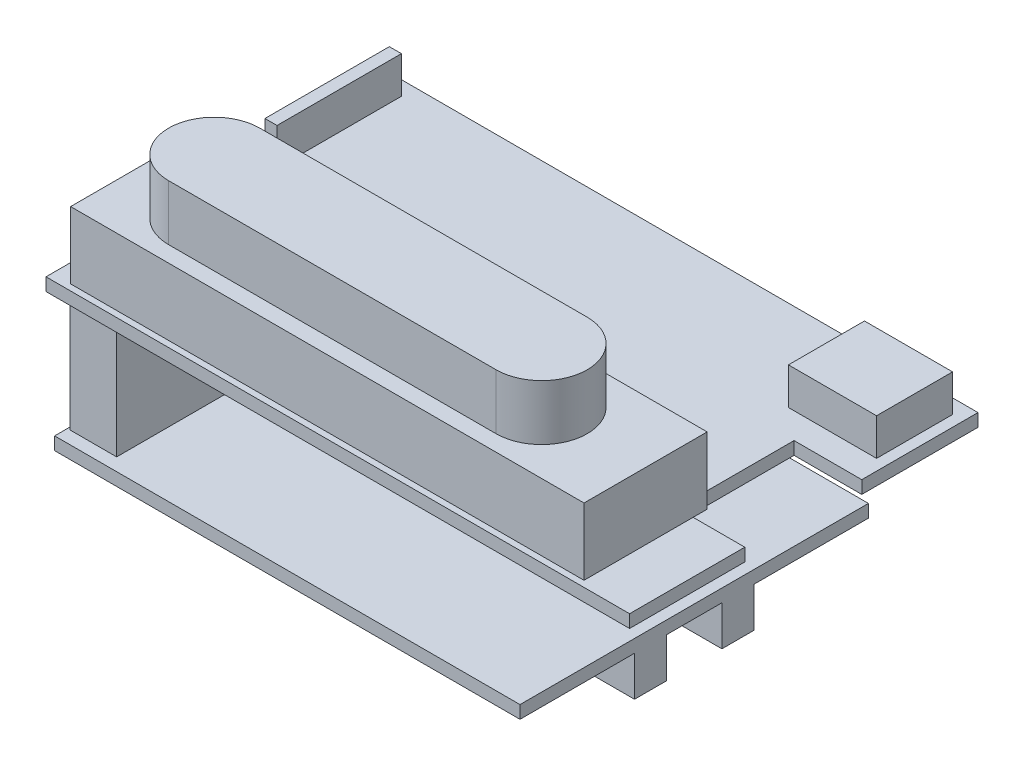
ISO-10303-21;
HEADER;
FILE_DESCRIPTION(('STEP AP214'),'2;1');
FILE_NAME('part.step','',(''),(''),'','','');
FILE_SCHEMA(('AUTOMOTIVE_DESIGN { 1 0 10303 214 1 1 1 1 }'));
ENDSEC;
DATA;
#1=APPLICATION_CONTEXT('core data for automotive mechanical design processes');
#2=APPLICATION_PROTOCOL_DEFINITION('international standard','automotive_design',2000,#1);
#3=PRODUCT_CONTEXT('',#1,'mechanical');
#4=PRODUCT('Part','Part','',(#3));
#5=PRODUCT_RELATED_PRODUCT_CATEGORY('part','',(#4));
#6=PRODUCT_DEFINITION_FORMATION('','',#4);
#7=PRODUCT_DEFINITION_CONTEXT('part definition',#1,'design');
#8=PRODUCT_DEFINITION('design','',#6,#7);
#9=PRODUCT_DEFINITION_SHAPE('','',#8);
#10=(LENGTH_UNIT() NAMED_UNIT(*) SI_UNIT(.MILLI.,.METRE.));
#11=(NAMED_UNIT(*) PLANE_ANGLE_UNIT() SI_UNIT($,.RADIAN.));
#12=(NAMED_UNIT(*) SI_UNIT($,.STERADIAN.) SOLID_ANGLE_UNIT());
#13=UNCERTAINTY_MEASURE_WITH_UNIT(LENGTH_MEASURE(1.E-05),#10,'distance_accuracy_value','');
#14=(GEOMETRIC_REPRESENTATION_CONTEXT(3) GLOBAL_UNCERTAINTY_ASSIGNED_CONTEXT((#13)) GLOBAL_UNIT_ASSIGNED_CONTEXT((#10,
#11,#12)) REPRESENTATION_CONTEXT('',''));
#15=CARTESIAN_POINT('',(0.,0.,0.));
#16=DIRECTION('',(0.,0.,1.));
#17=DIRECTION('',(1.,0.,0.));
#18=AXIS2_PLACEMENT_3D('',#15,#16,#17);
#19=CARTESIAN_POINT('',(6.604,-13.7668,-23.0505));
#20=DIRECTION('',(0.,-1.,0.));
#21=DIRECTION('',(0.,0.,-1.));
#22=AXIS2_PLACEMENT_3D('',#19,#20,#21);
#23=PLANE('',#22);
#24=DIRECTION('',(0.,0.,-1.));
#25=VECTOR('',#24,1.);
#26=CARTESIAN_POINT('',(33.1978,-13.7668,-24.13));
#27=LINE('',#26,#25);
#28=CARTESIAN_POINT('',(33.1978,-13.7668,-20.828));
#29=VERTEX_POINT('',#28);
#30=CARTESIAN_POINT('',(33.1978,-13.7668,-24.13));
#31=VERTEX_POINT('',#30);
#32=EDGE_CURVE('E724',#29,#31,#27,.T.);
#33=ORIENTED_EDGE('',*,*,#32,.F.);
#34=DIRECTION('',(-1.,0.,0.));
#35=VECTOR('',#34,1.);
#36=CARTESIAN_POINT('',(48.895,-13.7668,-20.828));
#37=LINE('',#36,#35);
#38=CARTESIAN_POINT('',(48.895,-13.7668,-20.828));
#39=VERTEX_POINT('',#38);
#40=EDGE_CURVE('E726',#39,#29,#37,.T.);
#41=ORIENTED_EDGE('',*,*,#40,.F.);
#42=DIRECTION('',(0.,0.,1.));
#43=VECTOR('',#42,1.);
#44=CARTESIAN_POINT('',(48.895,-13.7668,0.));
#45=LINE('',#44,#43);
#46=CARTESIAN_POINT('',(48.895,-13.7668,-15.113));
#47=VERTEX_POINT('',#46);
#48=EDGE_CURVE('E35',#39,#47,#45,.T.);
#49=ORIENTED_EDGE('',*,*,#48,.T.);
#50=DIRECTION('',(1.,0.,0.));
#51=VECTOR('',#50,1.);
#52=CARTESIAN_POINT('',(48.895,-13.7668,-15.113));
#53=LINE('',#52,#51);
#54=CARTESIAN_POINT('',(33.1978,-13.7668,-15.113));
#55=VERTEX_POINT('',#54);
#56=EDGE_CURVE('E58',#55,#47,#53,.T.);
#57=ORIENTED_EDGE('',*,*,#56,.F.);
#58=DIRECTION('',(0.,0.,-1.));
#59=VECTOR('',#58,1.);
#60=CARTESIAN_POINT('',(33.1978,-13.7668,-15.113));
#61=LINE('',#60,#59);
#62=CARTESIAN_POINT('',(33.1978,-13.7668,-11.811));
#63=VERTEX_POINT('',#62);
#64=EDGE_CURVE('E349',#63,#55,#61,.T.);
#65=ORIENTED_EDGE('',*,*,#64,.F.);
#66=DIRECTION('',(-1.,0.,0.));
#67=VECTOR('',#66,1.);
#68=CARTESIAN_POINT('',(48.895,-13.7668,-11.811));
#69=LINE('',#68,#67);
#70=CARTESIAN_POINT('',(48.895,-13.7668,-11.811));
#71=VERTEX_POINT('',#70);
#72=EDGE_CURVE('E346',#71,#63,#69,.T.);
#73=ORIENTED_EDGE('',*,*,#72,.F.);
#74=CARTESIAN_POINT('',(48.895,-13.7668,0.));
#75=VERTEX_POINT('',#74);
#76=EDGE_CURVE('E403',#71,#75,#45,.T.);
#77=ORIENTED_EDGE('',*,*,#76,.T.);
#78=DIRECTION('',(-1.,0.,0.));
#79=VECTOR('',#78,1.);
#80=CARTESIAN_POINT('',(0.889,-13.7668,0.));
#81=LINE('',#80,#79);
#82=CARTESIAN_POINT('',(0.889,-13.7668,0.));
#83=VERTEX_POINT('',#82);
#84=EDGE_CURVE('E406',#75,#83,#81,.T.);
#85=ORIENTED_EDGE('',*,*,#84,.T.);
#86=DIRECTION('',(0.,0.,-1.));
#87=VECTOR('',#86,1.);
#88=CARTESIAN_POINT('',(0.889,-13.7668,0.));
#89=LINE('',#88,#87);
#90=CARTESIAN_POINT('',(0.889000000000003,-13.7668,-21.336));
#91=VERTEX_POINT('',#90);
#92=EDGE_CURVE('E390',#83,#91,#89,.T.);
#93=ORIENTED_EDGE('',*,*,#92,.T.);
#94=DIRECTION('',(1.,0.,0.));
#95=VECTOR('',#94,1.);
#96=CARTESIAN_POINT('',(6.604,-13.7668,-21.336));
#97=LINE('',#96,#95);
#98=CARTESIAN_POINT('',(6.604,-13.7668,-21.336));
#99=VERTEX_POINT('',#98);
#100=EDGE_CURVE('E393',#91,#99,#97,.T.);
#101=ORIENTED_EDGE('',*,*,#100,.T.);
#102=CARTESIAN_POINT('',(6.604,-13.7668,-23.0505));
#103=DIRECTION('',(0.,1.,0.));
#104=DIRECTION('',(0.,0.,-1.));
#105=AXIS2_PLACEMENT_3D('',#102,#103,#104);
#106=CIRCLE('',#105,1.7145);
#107=CARTESIAN_POINT('',(6.604,-13.7668,-24.765));
#108=VERTEX_POINT('',#107);
#109=EDGE_CURVE('E396',#99,#108,#106,.T.);
#110=ORIENTED_EDGE('',*,*,#109,.T.);
#111=DIRECTION('',(-1.,0.,0.));
#112=VECTOR('',#111,1.);
#113=CARTESIAN_POINT('',(6.604,-13.7668,-24.765));
#114=LINE('',#113,#112);
#115=CARTESIAN_POINT('',(0.889000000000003,-13.7668,-24.765));
#116=VERTEX_POINT('',#115);
#117=EDGE_CURVE('E398',#108,#116,#114,.T.);
#118=ORIENTED_EDGE('',*,*,#117,.T.);
#119=DIRECTION('',(0.,0.,-1.));
#120=VECTOR('',#119,1.);
#121=CARTESIAN_POINT('',(0.889000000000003,-13.7668,-24.765));
#122=LINE('',#121,#120);
#123=CARTESIAN_POINT('',(0.889000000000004,-13.7668,-35.941));
#124=VERTEX_POINT('',#123);
#125=EDGE_CURVE('E400',#116,#124,#122,.T.);
#126=ORIENTED_EDGE('',*,*,#125,.T.);
#127=DIRECTION('',(1.,0.,0.));
#128=VECTOR('',#127,1.);
#129=CARTESIAN_POINT('',(0.889000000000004,-13.7668,-35.941));
#130=LINE('',#129,#128);
#131=CARTESIAN_POINT('',(48.895,-13.7668,-35.941));
#132=VERTEX_POINT('',#131);
#133=EDGE_CURVE('E402',#124,#132,#130,.T.);
#134=ORIENTED_EDGE('',*,*,#133,.T.);
#135=CARTESIAN_POINT('',(48.895,-13.7668,-24.13));
#136=VERTEX_POINT('',#135);
#137=EDGE_CURVE('E412',#132,#136,#45,.T.);
#138=ORIENTED_EDGE('',*,*,#137,.T.);
#139=DIRECTION('',(1.,0.,0.));
#140=VECTOR('',#139,1.);
#141=CARTESIAN_POINT('',(48.895,-13.7668,-24.13));
#142=LINE('',#141,#140);
#143=EDGE_CURVE('E341',#31,#136,#142,.T.);
#144=ORIENTED_EDGE('',*,*,#143,.F.);
#145=EDGE_LOOP('',(#33,#41,#49,#57,#65,#73,#77,#85,#93,#101,#110,#118,#126,#134,#138,#144));
#146=FACE_BOUND('',#145,.T.);
#147=ADVANCED_FACE('F31',(#146),#23,.T.);
#148=CARTESIAN_POINT('',(0.,0.,-35.941));
#149=DIRECTION('',(0.,-1.,0.));
#150=DIRECTION('',(0.,0.,-1.));
#151=AXIS2_PLACEMENT_3D('',#148,#149,#150);
#152=PLANE('',#151);
#153=DIRECTION('',(0.,0.,1.));
#154=VECTOR('',#153,1.);
#155=CARTESIAN_POINT('',(0.,0.,0.));
#156=LINE('',#155,#154);
#157=CARTESIAN_POINT('',(0.,0.,-35.941));
#158=VERTEX_POINT('',#157);
#159=CARTESIAN_POINT('',(0.,0.,0.));
#160=VERTEX_POINT('',#159);
#161=EDGE_CURVE('E454',#158,#160,#156,.T.);
#162=ORIENTED_EDGE('',*,*,#161,.F.);
#163=DIRECTION('',(-1.,0.,0.));
#164=VECTOR('',#163,1.);
#165=CARTESIAN_POINT('',(0.,0.,-35.941));
#166=LINE('',#165,#164);
#167=CARTESIAN_POINT('',(60.198,0.,-35.941));
#168=VERTEX_POINT('',#167);
#169=EDGE_CURVE('E439',#168,#158,#166,.T.);
#170=ORIENTED_EDGE('',*,*,#169,.F.);
#171=DIRECTION('',(0.,0.,-1.));
#172=VECTOR('',#171,1.);
#173=CARTESIAN_POINT('',(60.198,0.,-23.9522));
#174=LINE('',#173,#172);
#175=CARTESIAN_POINT('',(60.198,0.,-23.9522));
#176=VERTEX_POINT('',#175);
#177=EDGE_CURVE('E442',#176,#168,#174,.T.);
#178=ORIENTED_EDGE('',*,*,#177,.F.);
#179=DIRECTION('',(1.,0.,0.));
#180=VECTOR('',#179,1.);
#181=CARTESIAN_POINT('',(60.198,0.,-23.9522));
#182=LINE('',#181,#180);
#183=CARTESIAN_POINT('',(53.213,0.,-23.9522));
#184=VERTEX_POINT('',#183);
#185=EDGE_CURVE('E444',#184,#176,#182,.T.);
#186=ORIENTED_EDGE('',*,*,#185,.F.);
#187=DIRECTION('',(0.,0.,-1.));
#188=VECTOR('',#187,1.);
#189=CARTESIAN_POINT('',(53.213,0.,-23.9522));
#190=LINE('',#189,#188);
#191=CARTESIAN_POINT('',(53.213,0.,-11.8872));
#192=VERTEX_POINT('',#191);
#193=EDGE_CURVE('E446',#192,#184,#190,.T.);
#194=ORIENTED_EDGE('',*,*,#193,.F.);
#195=DIRECTION('',(-1.,0.,0.));
#196=VECTOR('',#195,1.);
#197=CARTESIAN_POINT('',(53.213,0.,-11.8872));
#198=LINE('',#197,#196);
#199=CARTESIAN_POINT('',(60.198,0.,-11.8872));
#200=VERTEX_POINT('',#199);
#201=EDGE_CURVE('E448',#200,#192,#198,.T.);
#202=ORIENTED_EDGE('',*,*,#201,.F.);
#203=DIRECTION('',(0.,0.,-1.));
#204=VECTOR('',#203,1.);
#205=CARTESIAN_POINT('',(60.198,0.,0.));
#206=LINE('',#205,#204);
#207=CARTESIAN_POINT('',(60.198,0.,0.));
#208=VERTEX_POINT('',#207);
#209=EDGE_CURVE('E450',#208,#200,#206,.T.);
#210=ORIENTED_EDGE('',*,*,#209,.F.);
#211=DIRECTION('',(1.,0.,0.));
#212=VECTOR('',#211,1.);
#213=CARTESIAN_POINT('',(0.,0.,0.));
#214=LINE('',#213,#212);
#215=EDGE_CURVE('E452',#160,#208,#214,.T.);
#216=ORIENTED_EDGE('',*,*,#215,.F.);
#217=EDGE_LOOP('',(#162,#170,#178,#186,#194,#202,#210,#216));
#218=FACE_BOUND('',#217,.T.);
#219=DIRECTION('',(1.,0.,0.));
#220=VECTOR('',#219,1.);
#221=CARTESIAN_POINT('',(1.143,0.,-18.8468));
#222=LINE('',#221,#220);
#223=CARTESIAN_POINT('',(1.143,0.,-18.8468));
#224=VERTEX_POINT('',#223);
#225=CARTESIAN_POINT('',(5.969,0.,-18.8468));
#226=VERTEX_POINT('',#225);
#227=EDGE_CURVE('E624',#224,#226,#222,.T.);
#228=ORIENTED_EDGE('',*,*,#227,.F.);
#229=DIRECTION('',(0.,0.,-1.));
#230=VECTOR('',#229,1.);
#231=CARTESIAN_POINT('',(1.143,0.,-1.3208));
#232=LINE('',#231,#230);
#233=CARTESIAN_POINT('',(1.143,0.,-1.3208));
#234=VERTEX_POINT('',#233);
#235=EDGE_CURVE('E626',#234,#224,#232,.T.);
#236=ORIENTED_EDGE('',*,*,#235,.F.);
#237=DIRECTION('',(-1.,0.,0.));
#238=VECTOR('',#237,1.);
#239=CARTESIAN_POINT('',(1.143,0.,-1.3208));
#240=LINE('',#239,#238);
#241=CARTESIAN_POINT('',(5.969,0.,-1.3208));
#242=VERTEX_POINT('',#241);
#243=EDGE_CURVE('E618',#242,#234,#240,.T.);
#244=ORIENTED_EDGE('',*,*,#243,.F.);
#245=DIRECTION('',(0.,0.,1.));
#246=VECTOR('',#245,1.);
#247=CARTESIAN_POINT('',(5.969,0.,-1.3208));
#248=LINE('',#247,#246);
#249=EDGE_CURVE('E621',#226,#242,#248,.T.);
#250=ORIENTED_EDGE('',*,*,#249,.F.);
#251=EDGE_LOOP('',(#228,#236,#244,#250));
#252=FACE_BOUND('',#251,.T.);
#253=ADVANCED_FACE('F740',(#218,#252),#152,.T.);
#254=CARTESIAN_POINT('',(0.,1.3208,-35.941));
#255=DIRECTION('',(0.,-1.,0.));
#256=DIRECTION('',(0.,0.,-1.));
#257=AXIS2_PLACEMENT_3D('',#254,#255,#256);
#258=PLANE('',#257);
#259=DIRECTION('',(0.,0.,-1.));
#260=VECTOR('',#259,1.);
#261=CARTESIAN_POINT('',(59.0605073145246,1.3208,-34.4562810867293));
#262=LINE('',#261,#260);
#263=CARTESIAN_POINT('',(59.0605073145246,1.3208,-26.6143960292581));
#264=VERTEX_POINT('',#263);
#265=CARTESIAN_POINT('',(59.0605073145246,1.3208,-34.4562810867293));
#266=VERTEX_POINT('',#265);
#267=EDGE_CURVE('E564',#264,#266,#262,.T.);
#268=ORIENTED_EDGE('',*,*,#267,.F.);
#269=DIRECTION('',(1.,0.,0.));
#270=VECTOR('',#269,1.);
#271=CARTESIAN_POINT('',(59.0605073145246,1.3208,-26.6143960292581));
#272=LINE('',#271,#270);
#273=CARTESIAN_POINT('',(49.9710496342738,1.3208,-26.6143960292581));
#274=VERTEX_POINT('',#273);
#275=EDGE_CURVE('E554',#274,#264,#272,.T.);
#276=ORIENTED_EDGE('',*,*,#275,.F.);
#277=DIRECTION('',(0.,0.,1.));
#278=VECTOR('',#277,1.);
#279=CARTESIAN_POINT('',(49.9710496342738,1.3208,-34.4562810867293));
#280=LINE('',#279,#278);
#281=CARTESIAN_POINT('',(49.9710496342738,1.3208,-34.4562810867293));
#282=VERTEX_POINT('',#281);
#283=EDGE_CURVE('E558',#282,#274,#280,.T.);
#284=ORIENTED_EDGE('',*,*,#283,.F.);
#285=DIRECTION('',(-1.,0.,0.));
#286=VECTOR('',#285,1.);
#287=CARTESIAN_POINT('',(59.0605073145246,1.3208,-34.4562810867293));
#288=LINE('',#287,#286);
#289=EDGE_CURVE('E561',#266,#282,#288,.T.);
#290=ORIENTED_EDGE('',*,*,#289,.F.);
#291=EDGE_LOOP('',(#268,#276,#284,#290));
#292=FACE_BOUND('',#291,.T.);
#293=DIRECTION('',(-1.,0.,0.));
#294=VECTOR('',#293,1.);
#295=CARTESIAN_POINT('',(1.905,1.3208,-13.335));
#296=LINE('',#295,#294);
#297=CARTESIAN_POINT('',(53.213,1.3208,-13.335));
#298=VERTEX_POINT('',#297);
#299=CARTESIAN_POINT('',(1.905,1.3208,-13.335));
#300=VERTEX_POINT('',#299);
#301=EDGE_CURVE('E11',#298,#300,#296,.T.);
#302=ORIENTED_EDGE('',*,*,#301,.F.);
#303=DIRECTION('',(0.,0.,-1.));
#304=VECTOR('',#303,1.);
#305=CARTESIAN_POINT('',(53.213,1.3208,-23.9522));
#306=LINE('',#305,#304);
#307=CARTESIAN_POINT('',(53.213,1.3208,-23.9522));
#308=VERTEX_POINT('',#307);
#309=EDGE_CURVE('E466',#298,#308,#306,.T.);
#310=ORIENTED_EDGE('',*,*,#309,.T.);
#311=DIRECTION('',(1.,0.,0.));
#312=VECTOR('',#311,1.);
#313=CARTESIAN_POINT('',(60.198,1.3208,-23.9522));
#314=LINE('',#313,#312);
#315=CARTESIAN_POINT('',(60.198,1.3208,-23.9522));
#316=VERTEX_POINT('',#315);
#317=EDGE_CURVE('E461',#308,#316,#314,.T.);
#318=ORIENTED_EDGE('',*,*,#317,.T.);
#319=DIRECTION('',(0.,0.,-1.));
#320=VECTOR('',#319,1.);
#321=CARTESIAN_POINT('',(60.198,1.3208,-23.9522));
#322=LINE('',#321,#320);
#323=CARTESIAN_POINT('',(60.198,1.3208,-35.941));
#324=VERTEX_POINT('',#323);
#325=EDGE_CURVE('E459',#316,#324,#322,.T.);
#326=ORIENTED_EDGE('',*,*,#325,.T.);
#327=DIRECTION('',(-1.,0.,0.));
#328=VECTOR('',#327,1.);
#329=CARTESIAN_POINT('',(0.,1.3208,-35.941));
#330=LINE('',#329,#328);
#331=CARTESIAN_POINT('',(0.,1.3208,-35.941));
#332=VERTEX_POINT('',#331);
#333=EDGE_CURVE('E438',#324,#332,#330,.T.);
#334=ORIENTED_EDGE('',*,*,#333,.T.);
#335=DIRECTION('',(0.,0.,1.));
#336=VECTOR('',#335,1.);
#337=CARTESIAN_POINT('',(0.,1.3208,0.));
#338=LINE('',#337,#336);
#339=CARTESIAN_POINT('',(0.,1.3208,0.));
#340=VERTEX_POINT('',#339);
#341=EDGE_CURVE('E441',#332,#340,#338,.T.);
#342=ORIENTED_EDGE('',*,*,#341,.T.);
#343=DIRECTION('',(1.,0.,0.));
#344=VECTOR('',#343,1.);
#345=CARTESIAN_POINT('',(0.,1.3208,0.));
#346=LINE('',#345,#344);
#347=CARTESIAN_POINT('',(60.198,1.3208,0.));
#348=VERTEX_POINT('',#347);
#349=EDGE_CURVE('E473',#340,#348,#346,.T.);
#350=ORIENTED_EDGE('',*,*,#349,.T.);
#351=DIRECTION('',(0.,0.,-1.));
#352=VECTOR('',#351,1.);
#353=CARTESIAN_POINT('',(60.198,1.3208,0.));
#354=LINE('',#353,#352);
#355=CARTESIAN_POINT('',(60.198,1.3208,-11.8872));
#356=VERTEX_POINT('',#355);
#357=EDGE_CURVE('E471',#348,#356,#354,.T.);
#358=ORIENTED_EDGE('',*,*,#357,.T.);
#359=DIRECTION('',(-1.,0.,0.));
#360=VECTOR('',#359,1.);
#361=CARTESIAN_POINT('',(53.213,1.3208,-11.8872));
#362=LINE('',#361,#360);
#363=CARTESIAN_POINT('',(54.864,1.3208,-11.8872));
#364=VERTEX_POINT('',#363);
#365=EDGE_CURVE('E467',#356,#364,#362,.T.);
#366=ORIENTED_EDGE('',*,*,#365,.T.);
#367=DIRECTION('',(0.,0.,-1.));
#368=VECTOR('',#367,1.);
#369=CARTESIAN_POINT('',(54.864,1.3208,-0.635));
#370=LINE('',#369,#368);
#371=CARTESIAN_POINT('',(54.864,1.3208,-0.635));
#372=VERTEX_POINT('',#371);
#373=EDGE_CURVE('E491',#372,#364,#370,.T.);
#374=ORIENTED_EDGE('',*,*,#373,.F.);
#375=DIRECTION('',(1.,0.,0.));
#376=VECTOR('',#375,1.);
#377=CARTESIAN_POINT('',(1.905,1.3208,-0.635));
#378=LINE('',#377,#376);
#379=CARTESIAN_POINT('',(1.905,1.3208,-0.635));
#380=VERTEX_POINT('',#379);
#381=EDGE_CURVE('E495',#380,#372,#378,.T.);
#382=ORIENTED_EDGE('',*,*,#381,.F.);
#383=DIRECTION('',(0.,0.,1.));
#384=VECTOR('',#383,1.);
#385=CARTESIAN_POINT('',(1.905,1.3208,-0.635));
#386=LINE('',#385,#384);
#387=EDGE_CURVE('E498',#300,#380,#386,.T.);
#388=ORIENTED_EDGE('',*,*,#387,.F.);
#389=EDGE_LOOP('',(#302,#310,#318,#326,#334,#342,#350,#358,#366,#374,#382,#388));
#390=FACE_BOUND('',#389,.T.);
#391=DIRECTION('',(0.,0.,1.));
#392=VECTOR('',#391,1.);
#393=CARTESIAN_POINT('',(0.959268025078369,1.3208,-34.4562810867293));
#394=LINE('',#393,#392);
#395=CARTESIAN_POINT('',(0.959268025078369,1.3208,-34.4562810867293));
#396=VERTEX_POINT('',#395);
#397=CARTESIAN_POINT('',(0.959268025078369,1.3208,-21.62410553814));
#398=VERTEX_POINT('',#397);
#399=EDGE_CURVE('E597',#396,#398,#394,.T.);
#400=ORIENTED_EDGE('',*,*,#399,.F.);
#401=DIRECTION('',(-1.,0.,0.));
#402=VECTOR('',#401,1.);
#403=CARTESIAN_POINT('',(0.959268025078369,1.3208,-34.4562810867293));
#404=LINE('',#403,#402);
#405=CARTESIAN_POINT('',(2.20684064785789,1.3208,-34.4562810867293));
#406=VERTEX_POINT('',#405);
#407=EDGE_CURVE('E587',#406,#396,#404,.T.);
#408=ORIENTED_EDGE('',*,*,#407,.F.);
#409=DIRECTION('',(0.,0.,-1.));
#410=VECTOR('',#409,1.);
#411=CARTESIAN_POINT('',(2.20684064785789,1.3208,-34.4562810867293));
#412=LINE('',#411,#410);
#413=CARTESIAN_POINT('',(2.20684064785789,1.3208,-21.62410553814));
#414=VERTEX_POINT('',#413);
#415=EDGE_CURVE('E591',#414,#406,#412,.T.);
#416=ORIENTED_EDGE('',*,*,#415,.F.);
#417=DIRECTION('',(1.,0.,0.));
#418=VECTOR('',#417,1.);
#419=CARTESIAN_POINT('',(0.959268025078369,1.3208,-21.62410553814));
#420=LINE('',#419,#418);
#421=EDGE_CURVE('E594',#398,#414,#420,.T.);
#422=ORIENTED_EDGE('',*,*,#421,.F.);
#423=EDGE_LOOP('',(#400,#408,#416,#422));
#424=FACE_BOUND('',#423,.T.);
#425=ADVANCED_FACE('F745',(#292,#390,#424),#258,.F.);
#426=CARTESIAN_POINT('',(1.905,8.2296,-13.335));
#427=DIRECTION('',(0.,-1.,0.));
#428=DIRECTION('',(0.,0.,-1.));
#429=AXIS2_PLACEMENT_3D('',#426,#427,#428);
#430=PLANE('',#429);
#431=DIRECTION('',(0.,0.,1.));
#432=VECTOR('',#431,1.);
#433=CARTESIAN_POINT('',(1.905,8.2296,-0.635));
#434=LINE('',#433,#432);
#435=CARTESIAN_POINT('',(1.905,8.2296,-13.335));
#436=VERTEX_POINT('',#435);
#437=CARTESIAN_POINT('',(1.905,8.2296,-0.635));
#438=VERTEX_POINT('',#437);
#439=EDGE_CURVE('E490',#436,#438,#434,.T.);
#440=ORIENTED_EDGE('',*,*,#439,.T.);
#441=DIRECTION('',(1.,0.,0.));
#442=VECTOR('',#441,1.);
#443=CARTESIAN_POINT('',(1.905,8.2296,-0.635));
#444=LINE('',#443,#442);
#445=CARTESIAN_POINT('',(54.864,8.2296,-0.635));
#446=VERTEX_POINT('',#445);
#447=EDGE_CURVE('E505',#438,#446,#444,.T.);
#448=ORIENTED_EDGE('',*,*,#447,.T.);
#449=DIRECTION('',(0.,0.,-1.));
#450=VECTOR('',#449,1.);
#451=CARTESIAN_POINT('',(54.864,8.2296,-0.635));
#452=LINE('',#451,#450);
#453=CARTESIAN_POINT('',(54.864,8.2296,-13.335));
#454=VERTEX_POINT('',#453);
#455=EDGE_CURVE('E503',#446,#454,#452,.T.);
#456=ORIENTED_EDGE('',*,*,#455,.T.);
#457=DIRECTION('',(-1.,0.,0.));
#458=VECTOR('',#457,1.);
#459=CARTESIAN_POINT('',(1.905,8.2296,-13.335));
#460=LINE('',#459,#458);
#461=EDGE_CURVE('E487',#454,#436,#460,.T.);
#462=ORIENTED_EDGE('',*,*,#461,.T.);
#463=EDGE_LOOP('',(#440,#448,#456,#462));
#464=FACE_BOUND('',#463,.T.);
#465=CARTESIAN_POINT('',(10.3625139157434,8.2296,-6.98499999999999));
#466=DIRECTION('',(0.,1.,0.));
#467=DIRECTION('',(0.,0.,1.));
#468=AXIS2_PLACEMENT_3D('',#465,#466,#467);
#469=CIRCLE('',#468,4.699);
#470=CARTESIAN_POINT('',(10.3625139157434,8.2296,-11.684));
#471=VERTEX_POINT('',#470);
#472=CARTESIAN_POINT('',(10.3625139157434,8.2296,-2.28599999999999));
#473=VERTEX_POINT('',#472);
#474=EDGE_CURVE('E531',#471,#473,#469,.T.);
#475=ORIENTED_EDGE('',*,*,#474,.F.);
#476=DIRECTION('',(-1.,0.,0.));
#477=VECTOR('',#476,1.);
#478=CARTESIAN_POINT('',(10.3625139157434,8.2296,-11.684));
#479=LINE('',#478,#477);
#480=CARTESIAN_POINT('',(44.1445139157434,8.2296,-11.684));
#481=VERTEX_POINT('',#480);
#482=EDGE_CURVE('E521',#481,#471,#479,.T.);
#483=ORIENTED_EDGE('',*,*,#482,.F.);
#484=CARTESIAN_POINT('',(44.1445139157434,8.2296,-6.985));
#485=DIRECTION('',(0.,1.,0.));
#486=DIRECTION('',(0.,0.,1.));
#487=AXIS2_PLACEMENT_3D('',#484,#485,#486);
#488=CIRCLE('',#487,4.699);
#489=CARTESIAN_POINT('',(44.1445139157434,8.2296,-2.28599999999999));
#490=VERTEX_POINT('',#489);
#491=EDGE_CURVE('E525',#490,#481,#488,.T.);
#492=ORIENTED_EDGE('',*,*,#491,.F.);
#493=DIRECTION('',(1.,0.,0.));
#494=VECTOR('',#493,1.);
#495=CARTESIAN_POINT('',(44.1445139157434,8.2296,-2.28599999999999));
#496=LINE('',#495,#494);
#497=EDGE_CURVE('E528',#473,#490,#496,.T.);
#498=ORIENTED_EDGE('',*,*,#497,.F.);
#499=EDGE_LOOP('',(#475,#483,#492,#498));
#500=FACE_BOUND('',#499,.T.);
#501=ADVANCED_FACE('F847',(#464,#500),#430,.F.);
#502=CARTESIAN_POINT('',(0.,1.3208,0.));
#503=DIRECTION('',(1.,0.,0.));
#504=DIRECTION('',(0.,0.,-1.));
#505=AXIS2_PLACEMENT_3D('',#502,#503,#504);
#506=PLANE('',#505);
#507=ORIENTED_EDGE('',*,*,#161,.T.);
#508=DIRECTION('',(0.,-1.,0.));
#509=VECTOR('',#508,1.);
#510=CARTESIAN_POINT('',(0.,1.3208,0.));
#511=LINE('',#510,#509);
#512=EDGE_CURVE('E41',#340,#160,#511,.T.);
#513=ORIENTED_EDGE('',*,*,#512,.F.);
#514=ORIENTED_EDGE('',*,*,#341,.F.);
#515=DIRECTION('',(0.,-1.,0.));
#516=VECTOR('',#515,1.);
#517=CARTESIAN_POINT('',(0.,1.3208,-35.941));
#518=LINE('',#517,#516);
#519=EDGE_CURVE('E435',#332,#158,#518,.T.);
#520=ORIENTED_EDGE('',*,*,#519,.T.);
#521=EDGE_LOOP('',(#507,#513,#514,#520));
#522=FACE_BOUND('',#521,.T.);
#523=ADVANCED_FACE('F33',(#522),#506,.F.);
#524=CARTESIAN_POINT('',(0.,1.3208,0.));
#525=DIRECTION('',(0.,0.,-1.));
#526=DIRECTION('',(-1.,0.,0.));
#527=AXIS2_PLACEMENT_3D('',#524,#525,#526);
#528=PLANE('',#527);
#529=ORIENTED_EDGE('',*,*,#215,.T.);
#530=DIRECTION('',(0.,-1.,0.));
#531=VECTOR('',#530,1.);
#532=CARTESIAN_POINT('',(60.198,1.3208,0.));
#533=LINE('',#532,#531);
#534=EDGE_CURVE('E417',#348,#208,#533,.T.);
#535=ORIENTED_EDGE('',*,*,#534,.F.);
#536=ORIENTED_EDGE('',*,*,#349,.F.);
#537=ORIENTED_EDGE('',*,*,#512,.T.);
#538=EDGE_LOOP('',(#529,#535,#536,#537));
#539=FACE_BOUND('',#538,.T.);
#540=ADVANCED_FACE('F895',(#539),#528,.F.);
#541=CARTESIAN_POINT('',(60.198,1.3208,0.));
#542=DIRECTION('',(-1.,0.,0.));
#543=DIRECTION('',(0.,0.,1.));
#544=AXIS2_PLACEMENT_3D('',#541,#542,#543);
#545=PLANE('',#544);
#546=ORIENTED_EDGE('',*,*,#209,.T.);
#547=DIRECTION('',(0.,-1.,0.));
#548=VECTOR('',#547,1.);
#549=CARTESIAN_POINT('',(60.198,1.3208,-11.8872));
#550=LINE('',#549,#548);
#551=EDGE_CURVE('E420',#356,#200,#550,.T.);
#552=ORIENTED_EDGE('',*,*,#551,.F.);
#553=ORIENTED_EDGE('',*,*,#357,.F.);
#554=ORIENTED_EDGE('',*,*,#534,.T.);
#555=EDGE_LOOP('',(#546,#552,#553,#554));
#556=FACE_BOUND('',#555,.T.);
#557=ADVANCED_FACE('F892',(#556),#545,.F.);
#558=CARTESIAN_POINT('',(53.213,1.3208,-11.8872));
#559=DIRECTION('',(0.,0.,1.));
#560=DIRECTION('',(1.,0.,0.));
#561=AXIS2_PLACEMENT_3D('',#558,#559,#560);
#562=PLANE('',#561);
#563=ORIENTED_EDGE('',*,*,#201,.T.);
#564=DIRECTION('',(0.,-1.,0.));
#565=VECTOR('',#564,1.);
#566=CARTESIAN_POINT('',(53.213,1.3208,-11.8872));
#567=LINE('',#566,#565);
#568=CARTESIAN_POINT('',(53.213,1.3208,-11.8872));
#569=VERTEX_POINT('',#568);
#570=EDGE_CURVE('E423',#569,#192,#567,.T.);
#571=ORIENTED_EDGE('',*,*,#570,.F.);
#572=EDGE_CURVE('E470',#364,#569,#362,.T.);
#573=ORIENTED_EDGE('',*,*,#572,.F.);
#574=ORIENTED_EDGE('',*,*,#365,.F.);
#575=ORIENTED_EDGE('',*,*,#551,.T.);
#576=EDGE_LOOP('',(#563,#571,#573,#574,#575));
#577=FACE_BOUND('',#576,.T.);
#578=ADVANCED_FACE('F888',(#577),#562,.F.);
#579=CARTESIAN_POINT('',(53.213,1.3208,-23.9522));
#580=DIRECTION('',(-1.,0.,0.));
#581=DIRECTION('',(0.,0.,1.));
#582=AXIS2_PLACEMENT_3D('',#579,#580,#581);
#583=PLANE('',#582);
#584=ORIENTED_EDGE('',*,*,#193,.T.);
#585=DIRECTION('',(0.,-1.,0.));
#586=VECTOR('',#585,1.);
#587=CARTESIAN_POINT('',(53.213,1.3208,-23.9522));
#588=LINE('',#587,#586);
#589=EDGE_CURVE('E426',#308,#184,#588,.T.);
#590=ORIENTED_EDGE('',*,*,#589,.F.);
#591=ORIENTED_EDGE('',*,*,#309,.F.);
#592=EDGE_CURVE('E463',#569,#298,#306,.T.);
#593=ORIENTED_EDGE('',*,*,#592,.F.);
#594=ORIENTED_EDGE('',*,*,#570,.T.);
#595=EDGE_LOOP('',(#584,#590,#591,#593,#594));
#596=FACE_BOUND('',#595,.T.);
#597=ADVANCED_FACE('F884',(#596),#583,.F.);
#598=CARTESIAN_POINT('',(60.198,1.3208,-23.9522));
#599=DIRECTION('',(0.,0.,-1.));
#600=DIRECTION('',(-1.,0.,0.));
#601=AXIS2_PLACEMENT_3D('',#598,#599,#600);
#602=PLANE('',#601);
#603=ORIENTED_EDGE('',*,*,#185,.T.);
#604=DIRECTION('',(0.,-1.,0.));
#605=VECTOR('',#604,1.);
#606=CARTESIAN_POINT('',(60.198,1.3208,-23.9522));
#607=LINE('',#606,#605);
#608=EDGE_CURVE('E429',#316,#176,#607,.T.);
#609=ORIENTED_EDGE('',*,*,#608,.F.);
#610=ORIENTED_EDGE('',*,*,#317,.F.);
#611=ORIENTED_EDGE('',*,*,#589,.T.);
#612=EDGE_LOOP('',(#603,#609,#610,#611));
#613=FACE_BOUND('',#612,.T.);
#614=ADVANCED_FACE('F880',(#613),#602,.F.);
#615=CARTESIAN_POINT('',(60.198,1.3208,-23.9522));
#616=DIRECTION('',(-1.,0.,0.));
#617=DIRECTION('',(0.,0.,1.));
#618=AXIS2_PLACEMENT_3D('',#615,#616,#617);
#619=PLANE('',#618);
#620=ORIENTED_EDGE('',*,*,#177,.T.);
#621=DIRECTION('',(0.,-1.,0.));
#622=VECTOR('',#621,1.);
#623=CARTESIAN_POINT('',(60.198,1.3208,-35.941));
#624=LINE('',#623,#622);
#625=EDGE_CURVE('E432',#324,#168,#624,.T.);
#626=ORIENTED_EDGE('',*,*,#625,.F.);
#627=ORIENTED_EDGE('',*,*,#325,.F.);
#628=ORIENTED_EDGE('',*,*,#608,.T.);
#629=EDGE_LOOP('',(#620,#626,#627,#628));
#630=FACE_BOUND('',#629,.T.);
#631=ADVANCED_FACE('F876',(#630),#619,.F.);
#632=CARTESIAN_POINT('',(0.,1.3208,-35.941));
#633=DIRECTION('',(0.,0.,1.));
#634=DIRECTION('',(1.,0.,0.));
#635=AXIS2_PLACEMENT_3D('',#632,#633,#634);
#636=PLANE('',#635);
#637=ORIENTED_EDGE('',*,*,#169,.T.);
#638=ORIENTED_EDGE('',*,*,#519,.F.);
#639=ORIENTED_EDGE('',*,*,#333,.F.);
#640=ORIENTED_EDGE('',*,*,#625,.T.);
#641=EDGE_LOOP('',(#637,#638,#639,#640));
#642=FACE_BOUND('',#641,.T.);
#643=ADVANCED_FACE('F869',(#642),#636,.F.);
#644=CARTESIAN_POINT('',(1.905,8.2296,-0.635));
#645=DIRECTION('',(1.,0.,0.));
#646=DIRECTION('',(0.,0.,-1.));
#647=AXIS2_PLACEMENT_3D('',#644,#645,#646);
#648=PLANE('',#647);
#649=ORIENTED_EDGE('',*,*,#387,.T.);
#650=DIRECTION('',(0.,-1.,0.));
#651=VECTOR('',#650,1.);
#652=CARTESIAN_POINT('',(1.905,8.2296,-0.635));
#653=LINE('',#652,#651);
#654=EDGE_CURVE('E457',#438,#380,#653,.T.);
#655=ORIENTED_EDGE('',*,*,#654,.F.);
#656=ORIENTED_EDGE('',*,*,#439,.F.);
#657=DIRECTION('',(0.,-1.,0.));
#658=VECTOR('',#657,1.);
#659=CARTESIAN_POINT('',(1.905,8.2296,-13.335));
#660=LINE('',#659,#658);
#661=EDGE_CURVE('E485',#436,#300,#660,.T.);
#662=ORIENTED_EDGE('',*,*,#661,.T.);
#663=EDGE_LOOP('',(#649,#655,#656,#662));
#664=FACE_BOUND('',#663,.T.);
#665=ADVANCED_FACE('F865',(#664),#648,.F.);
#666=CARTESIAN_POINT('',(1.905,8.2296,-0.635));
#667=DIRECTION('',(0.,0.,-1.));
#668=DIRECTION('',(-1.,0.,0.));
#669=AXIS2_PLACEMENT_3D('',#666,#667,#668);
#670=PLANE('',#669);
#671=ORIENTED_EDGE('',*,*,#381,.T.);
#672=DIRECTION('',(0.,-1.,0.));
#673=VECTOR('',#672,1.);
#674=CARTESIAN_POINT('',(54.864,8.2296,-0.635));
#675=LINE('',#674,#673);
#676=EDGE_CURVE('E479',#446,#372,#675,.T.);
#677=ORIENTED_EDGE('',*,*,#676,.F.);
#678=ORIENTED_EDGE('',*,*,#447,.F.);
#679=ORIENTED_EDGE('',*,*,#654,.T.);
#680=EDGE_LOOP('',(#671,#677,#678,#679));
#681=FACE_BOUND('',#680,.T.);
#682=ADVANCED_FACE('F861',(#681),#670,.F.);
#683=CARTESIAN_POINT('',(54.864,8.2296,-0.635));
#684=DIRECTION('',(-1.,0.,0.));
#685=DIRECTION('',(0.,0.,1.));
#686=AXIS2_PLACEMENT_3D('',#683,#684,#685);
#687=PLANE('',#686);
#688=ORIENTED_EDGE('',*,*,#373,.T.);
#689=CARTESIAN_POINT('',(54.864,1.3208,-13.335));
#690=VERTEX_POINT('',#689);
#691=EDGE_CURVE('E494',#364,#690,#370,.T.);
#692=ORIENTED_EDGE('',*,*,#691,.T.);
#693=DIRECTION('',(0.,-1.,0.));
#694=VECTOR('',#693,1.);
#695=CARTESIAN_POINT('',(54.864,8.2296,-13.335));
#696=LINE('',#695,#694);
#697=EDGE_CURVE('E482',#454,#690,#696,.T.);
#698=ORIENTED_EDGE('',*,*,#697,.F.);
#699=ORIENTED_EDGE('',*,*,#455,.F.);
#700=ORIENTED_EDGE('',*,*,#676,.T.);
#701=EDGE_LOOP('',(#688,#692,#698,#699,#700));
#702=FACE_BOUND('',#701,.T.);
#703=ADVANCED_FACE('F857',(#702),#687,.F.);
#704=CARTESIAN_POINT('',(1.905,8.2296,-13.335));
#705=DIRECTION('',(0.,0.,1.));
#706=DIRECTION('',(1.,0.,0.));
#707=AXIS2_PLACEMENT_3D('',#704,#705,#706);
#708=PLANE('',#707);
#709=EDGE_CURVE('E43',#690,#298,#296,.T.);
#710=ORIENTED_EDGE('',*,*,#709,.T.);
#711=ORIENTED_EDGE('',*,*,#301,.T.);
#712=ORIENTED_EDGE('',*,*,#661,.F.);
#713=ORIENTED_EDGE('',*,*,#461,.F.);
#714=ORIENTED_EDGE('',*,*,#697,.T.);
#715=EDGE_LOOP('',(#710,#711,#712,#713,#714));
#716=FACE_BOUND('',#715,.T.);
#717=ADVANCED_FACE('F853',(#716),#708,.F.);
#718=CARTESIAN_POINT('',(1.905,1.3208,-13.335));
#719=DIRECTION('',(0.,-1.,0.));
#720=DIRECTION('',(0.,0.,-1.));
#721=AXIS2_PLACEMENT_3D('',#718,#719,#720);
#722=PLANE('',#721);
#723=ORIENTED_EDGE('',*,*,#691,.F.);
#724=ORIENTED_EDGE('',*,*,#572,.T.);
#725=ORIENTED_EDGE('',*,*,#592,.T.);
#726=ORIENTED_EDGE('',*,*,#709,.F.);
#727=EDGE_LOOP('',(#723,#724,#725,#726));
#728=FACE_BOUND('',#727,.T.);
#729=ADVANCED_FACE('F845',(#728),#722,.T.);
#730=CARTESIAN_POINT('',(10.3625139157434,13.9446,-6.98499999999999));
#731=DIRECTION('',(0.,-1.,0.));
#732=DIRECTION('',(0.,0.,-1.));
#733=AXIS2_PLACEMENT_3D('',#730,#731,#732);
#734=CYLINDRICAL_SURFACE('',#733,4.699);
#735=ORIENTED_EDGE('',*,*,#474,.T.);
#736=DIRECTION('',(0.,-1.,0.));
#737=VECTOR('',#736,1.);
#738=CARTESIAN_POINT('',(10.3625139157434,13.9446,-2.28599999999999));
#739=LINE('',#738,#737);
#740=CARTESIAN_POINT('',(10.3625139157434,13.9446,-2.28599999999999));
#741=VERTEX_POINT('',#740);
#742=EDGE_CURVE('E501',#741,#473,#739,.T.);
#743=ORIENTED_EDGE('',*,*,#742,.F.);
#744=CARTESIAN_POINT('',(10.3625139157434,13.9446,-6.98499999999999));
#745=DIRECTION('',(0.,1.,0.));
#746=DIRECTION('',(0.,0.,1.));
#747=AXIS2_PLACEMENT_3D('',#744,#745,#746);
#748=CIRCLE('',#747,4.699);
#749=CARTESIAN_POINT('',(10.3625139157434,13.9446,-11.684));
#750=VERTEX_POINT('',#749);
#751=EDGE_CURVE('E524',#750,#741,#748,.T.);
#752=ORIENTED_EDGE('',*,*,#751,.F.);
#753=DIRECTION('',(0.,-1.,0.));
#754=VECTOR('',#753,1.);
#755=CARTESIAN_POINT('',(10.3625139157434,13.9446,-11.684));
#756=LINE('',#755,#754);
#757=EDGE_CURVE('E517',#750,#471,#756,.T.);
#758=ORIENTED_EDGE('',*,*,#757,.T.);
#759=EDGE_LOOP('',(#735,#743,#752,#758));
#760=FACE_BOUND('',#759,.T.);
#761=ADVANCED_FACE('F841',(#760),#734,.T.);
#762=CARTESIAN_POINT('',(44.1445139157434,13.9446,-2.28599999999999));
#763=DIRECTION('',(0.,0.,-1.));
#764=DIRECTION('',(-1.,0.,0.));
#765=AXIS2_PLACEMENT_3D('',#762,#763,#764);
#766=PLANE('',#765);
#767=ORIENTED_EDGE('',*,*,#497,.T.);
#768=DIRECTION('',(0.,-1.,0.));
#769=VECTOR('',#768,1.);
#770=CARTESIAN_POINT('',(44.1445139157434,13.9446,-2.28599999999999));
#771=LINE('',#770,#769);
#772=CARTESIAN_POINT('',(44.1445139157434,13.9446,-2.28599999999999));
#773=VERTEX_POINT('',#772);
#774=EDGE_CURVE('E511',#773,#490,#771,.T.);
#775=ORIENTED_EDGE('',*,*,#774,.F.);
#776=DIRECTION('',(1.,0.,0.));
#777=VECTOR('',#776,1.);
#778=CARTESIAN_POINT('',(44.1445139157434,13.9446,-2.28599999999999));
#779=LINE('',#778,#777);
#780=EDGE_CURVE('E538',#741,#773,#779,.T.);
#781=ORIENTED_EDGE('',*,*,#780,.F.);
#782=ORIENTED_EDGE('',*,*,#742,.T.);
#783=EDGE_LOOP('',(#767,#775,#781,#782));
#784=FACE_BOUND('',#783,.T.);
#785=ADVANCED_FACE('F837',(#784),#766,.F.);
#786=CARTESIAN_POINT('',(44.1445139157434,13.9446,-6.985));
#787=DIRECTION('',(0.,-1.,0.));
#788=DIRECTION('',(0.,0.,-1.));
#789=AXIS2_PLACEMENT_3D('',#786,#787,#788);
#790=CYLINDRICAL_SURFACE('',#789,4.699);
#791=ORIENTED_EDGE('',*,*,#491,.T.);
#792=DIRECTION('',(0.,-1.,0.));
#793=VECTOR('',#792,1.);
#794=CARTESIAN_POINT('',(44.1445139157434,13.9446,-11.684));
#795=LINE('',#794,#793);
#796=CARTESIAN_POINT('',(44.1445139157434,13.9446,-11.684));
#797=VERTEX_POINT('',#796);
#798=EDGE_CURVE('E514',#797,#481,#795,.T.);
#799=ORIENTED_EDGE('',*,*,#798,.F.);
#800=CARTESIAN_POINT('',(44.1445139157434,13.9446,-6.985));
#801=DIRECTION('',(0.,1.,0.));
#802=DIRECTION('',(0.,0.,1.));
#803=AXIS2_PLACEMENT_3D('',#800,#801,#802);
#804=CIRCLE('',#803,4.699);
#805=EDGE_CURVE('E536',#773,#797,#804,.T.);
#806=ORIENTED_EDGE('',*,*,#805,.F.);
#807=ORIENTED_EDGE('',*,*,#774,.T.);
#808=EDGE_LOOP('',(#791,#799,#806,#807));
#809=FACE_BOUND('',#808,.T.);
#810=ADVANCED_FACE('F833',(#809),#790,.T.);
#811=CARTESIAN_POINT('',(10.3625139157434,13.9446,-11.684));
#812=DIRECTION('',(0.,0.,1.));
#813=DIRECTION('',(1.,0.,0.));
#814=AXIS2_PLACEMENT_3D('',#811,#812,#813);
#815=PLANE('',#814);
#816=ORIENTED_EDGE('',*,*,#482,.T.);
#817=ORIENTED_EDGE('',*,*,#757,.F.);
#818=DIRECTION('',(-1.,0.,0.));
#819=VECTOR('',#818,1.);
#820=CARTESIAN_POINT('',(10.3625139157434,13.9446,-11.684));
#821=LINE('',#820,#819);
#822=EDGE_CURVE('E520',#797,#750,#821,.T.);
#823=ORIENTED_EDGE('',*,*,#822,.F.);
#824=ORIENTED_EDGE('',*,*,#798,.T.);
#825=EDGE_LOOP('',(#816,#817,#823,#824));
#826=FACE_BOUND('',#825,.T.);
#827=ADVANCED_FACE('F829',(#826),#815,.F.);
#828=CARTESIAN_POINT('',(10.3625139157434,13.9446,-6.98499999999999));
#829=DIRECTION('',(0.,1.,0.));
#830=DIRECTION('',(0.,0.,1.));
#831=AXIS2_PLACEMENT_3D('',#828,#829,#830);
#832=PLANE('',#831);
#833=ORIENTED_EDGE('',*,*,#751,.T.);
#834=ORIENTED_EDGE('',*,*,#780,.T.);
#835=ORIENTED_EDGE('',*,*,#805,.T.);
#836=ORIENTED_EDGE('',*,*,#822,.T.);
#837=EDGE_LOOP('',(#833,#834,#835,#836));
#838=FACE_BOUND('',#837,.T.);
#839=ADVANCED_FACE('F825',(#838),#832,.T.);
#840=CARTESIAN_POINT('',(59.0605073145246,5.1308,-34.4562810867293));
#841=DIRECTION('',(-1.,0.,0.));
#842=DIRECTION('',(0.,0.,1.));
#843=AXIS2_PLACEMENT_3D('',#840,#841,#842);
#844=PLANE('',#843);
#845=ORIENTED_EDGE('',*,*,#267,.T.);
#846=DIRECTION('',(0.,-1.,0.));
#847=VECTOR('',#846,1.);
#848=CARTESIAN_POINT('',(59.0605073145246,5.1308,-34.4562810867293));
#849=LINE('',#848,#847);
#850=CARTESIAN_POINT('',(59.0605073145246,5.1308,-34.4562810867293));
#851=VERTEX_POINT('',#850);
#852=EDGE_CURVE('E534',#851,#266,#849,.T.);
#853=ORIENTED_EDGE('',*,*,#852,.F.);
#854=DIRECTION('',(0.,0.,-1.));
#855=VECTOR('',#854,1.);
#856=CARTESIAN_POINT('',(59.0605073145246,5.1308,-34.4562810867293));
#857=LINE('',#856,#855);
#858=CARTESIAN_POINT('',(59.0605073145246,5.1308,-26.6143960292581));
#859=VERTEX_POINT('',#858);
#860=EDGE_CURVE('E557',#859,#851,#857,.T.);
#861=ORIENTED_EDGE('',*,*,#860,.F.);
#862=DIRECTION('',(0.,-1.,0.));
#863=VECTOR('',#862,1.);
#864=CARTESIAN_POINT('',(59.0605073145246,5.1308,-26.6143960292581));
#865=LINE('',#864,#863);
#866=EDGE_CURVE('E550',#859,#264,#865,.T.);
#867=ORIENTED_EDGE('',*,*,#866,.T.);
#868=EDGE_LOOP('',(#845,#853,#861,#867));
#869=FACE_BOUND('',#868,.T.);
#870=ADVANCED_FACE('F821',(#869),#844,.F.);
#871=CARTESIAN_POINT('',(59.0605073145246,5.1308,-34.4562810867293));
#872=DIRECTION('',(0.,0.,1.));
#873=DIRECTION('',(1.,0.,0.));
#874=AXIS2_PLACEMENT_3D('',#871,#872,#873);
#875=PLANE('',#874);
#876=ORIENTED_EDGE('',*,*,#289,.T.);
#877=DIRECTION('',(0.,-1.,0.));
#878=VECTOR('',#877,1.);
#879=CARTESIAN_POINT('',(49.9710496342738,5.1308,-34.4562810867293));
#880=LINE('',#879,#878);
#881=CARTESIAN_POINT('',(49.9710496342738,5.1308,-34.4562810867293));
#882=VERTEX_POINT('',#881);
#883=EDGE_CURVE('E544',#882,#282,#880,.T.);
#884=ORIENTED_EDGE('',*,*,#883,.F.);
#885=DIRECTION('',(-1.,0.,0.));
#886=VECTOR('',#885,1.);
#887=CARTESIAN_POINT('',(59.0605073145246,5.1308,-34.4562810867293));
#888=LINE('',#887,#886);
#889=EDGE_CURVE('E571',#851,#882,#888,.T.);
#890=ORIENTED_EDGE('',*,*,#889,.F.);
#891=ORIENTED_EDGE('',*,*,#852,.T.);
#892=EDGE_LOOP('',(#876,#884,#890,#891));
#893=FACE_BOUND('',#892,.T.);
#894=ADVANCED_FACE('F817',(#893),#875,.F.);
#895=CARTESIAN_POINT('',(49.9710496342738,5.1308,-34.4562810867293));
#896=DIRECTION('',(1.,0.,0.));
#897=DIRECTION('',(0.,0.,-1.));
#898=AXIS2_PLACEMENT_3D('',#895,#896,#897);
#899=PLANE('',#898);
#900=ORIENTED_EDGE('',*,*,#283,.T.);
#901=DIRECTION('',(0.,-1.,0.));
#902=VECTOR('',#901,1.);
#903=CARTESIAN_POINT('',(49.9710496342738,5.1308,-26.6143960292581));
#904=LINE('',#903,#902);
#905=CARTESIAN_POINT('',(49.9710496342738,5.1308,-26.6143960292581));
#906=VERTEX_POINT('',#905);
#907=EDGE_CURVE('E547',#906,#274,#904,.T.);
#908=ORIENTED_EDGE('',*,*,#907,.F.);
#909=DIRECTION('',(0.,0.,1.));
#910=VECTOR('',#909,1.);
#911=CARTESIAN_POINT('',(49.9710496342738,5.1308,-34.4562810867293));
#912=LINE('',#911,#910);
#913=EDGE_CURVE('E569',#882,#906,#912,.T.);
#914=ORIENTED_EDGE('',*,*,#913,.F.);
#915=ORIENTED_EDGE('',*,*,#883,.T.);
#916=EDGE_LOOP('',(#900,#908,#914,#915));
#917=FACE_BOUND('',#916,.T.);
#918=ADVANCED_FACE('F813',(#917),#899,.F.);
#919=CARTESIAN_POINT('',(59.0605073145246,5.1308,-26.6143960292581));
#920=DIRECTION('',(0.,0.,-1.));
#921=DIRECTION('',(-1.,0.,0.));
#922=AXIS2_PLACEMENT_3D('',#919,#920,#921);
#923=PLANE('',#922);
#924=ORIENTED_EDGE('',*,*,#275,.T.);
#925=ORIENTED_EDGE('',*,*,#866,.F.);
#926=DIRECTION('',(1.,0.,0.));
#927=VECTOR('',#926,1.);
#928=CARTESIAN_POINT('',(59.0605073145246,5.1308,-26.6143960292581));
#929=LINE('',#928,#927);
#930=EDGE_CURVE('E553',#906,#859,#929,.T.);
#931=ORIENTED_EDGE('',*,*,#930,.F.);
#932=ORIENTED_EDGE('',*,*,#907,.T.);
#933=EDGE_LOOP('',(#924,#925,#931,#932));
#934=FACE_BOUND('',#933,.T.);
#935=ADVANCED_FACE('F809',(#934),#923,.F.);
#936=CARTESIAN_POINT('',(59.0605073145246,5.1308,-26.6143960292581));
#937=DIRECTION('',(0.,-1.,0.));
#938=DIRECTION('',(0.,0.,-1.));
#939=AXIS2_PLACEMENT_3D('',#936,#937,#938);
#940=PLANE('',#939);
#941=ORIENTED_EDGE('',*,*,#860,.T.);
#942=ORIENTED_EDGE('',*,*,#889,.T.);
#943=ORIENTED_EDGE('',*,*,#913,.T.);
#944=ORIENTED_EDGE('',*,*,#930,.T.);
#945=EDGE_LOOP('',(#941,#942,#943,#944));
#946=FACE_BOUND('',#945,.T.);
#947=ADVANCED_FACE('F805',(#946),#940,.F.);
#948=CARTESIAN_POINT('',(0.959268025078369,5.1308,-34.4562810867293));
#949=DIRECTION('',(1.,0.,0.));
#950=DIRECTION('',(0.,0.,-1.));
#951=AXIS2_PLACEMENT_3D('',#948,#949,#950);
#952=PLANE('',#951);
#953=ORIENTED_EDGE('',*,*,#399,.T.);
#954=DIRECTION('',(0.,-1.,0.));
#955=VECTOR('',#954,1.);
#956=CARTESIAN_POINT('',(0.959268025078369,5.1308,-21.62410553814));
#957=LINE('',#956,#955);
#958=CARTESIAN_POINT('',(0.959268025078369,5.1308,-21.62410553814));
#959=VERTEX_POINT('',#958);
#960=EDGE_CURVE('E567',#959,#398,#957,.T.);
#961=ORIENTED_EDGE('',*,*,#960,.F.);
#962=DIRECTION('',(0.,0.,1.));
#963=VECTOR('',#962,1.);
#964=CARTESIAN_POINT('',(0.959268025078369,5.1308,-34.4562810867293));
#965=LINE('',#964,#963);
#966=CARTESIAN_POINT('',(0.959268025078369,5.1308,-34.4562810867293));
#967=VERTEX_POINT('',#966);
#968=EDGE_CURVE('E590',#967,#959,#965,.T.);
#969=ORIENTED_EDGE('',*,*,#968,.F.);
#970=DIRECTION('',(0.,-1.,0.));
#971=VECTOR('',#970,1.);
#972=CARTESIAN_POINT('',(0.959268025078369,5.1308,-34.4562810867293));
#973=LINE('',#972,#971);
#974=EDGE_CURVE('E583',#967,#396,#973,.T.);
#975=ORIENTED_EDGE('',*,*,#974,.T.);
#976=EDGE_LOOP('',(#953,#961,#969,#975));
#977=FACE_BOUND('',#976,.T.);
#978=ADVANCED_FACE('F801',(#977),#952,.F.);
#979=CARTESIAN_POINT('',(0.959268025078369,5.1308,-21.62410553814));
#980=DIRECTION('',(0.,0.,-1.));
#981=DIRECTION('',(-1.,0.,0.));
#982=AXIS2_PLACEMENT_3D('',#979,#980,#981);
#983=PLANE('',#982);
#984=ORIENTED_EDGE('',*,*,#421,.T.);
#985=DIRECTION('',(0.,-1.,0.));
#986=VECTOR('',#985,1.);
#987=CARTESIAN_POINT('',(2.20684064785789,5.1308,-21.62410553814));
#988=LINE('',#987,#986);
#989=CARTESIAN_POINT('',(2.20684064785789,5.1308,-21.62410553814));
#990=VERTEX_POINT('',#989);
#991=EDGE_CURVE('E577',#990,#414,#988,.T.);
#992=ORIENTED_EDGE('',*,*,#991,.F.);
#993=DIRECTION('',(1.,0.,0.));
#994=VECTOR('',#993,1.);
#995=CARTESIAN_POINT('',(0.959268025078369,5.1308,-21.62410553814));
#996=LINE('',#995,#994);
#997=EDGE_CURVE('E604',#959,#990,#996,.T.);
#998=ORIENTED_EDGE('',*,*,#997,.F.);
#999=ORIENTED_EDGE('',*,*,#960,.T.);
#1000=EDGE_LOOP('',(#984,#992,#998,#999));
#1001=FACE_BOUND('',#1000,.T.);
#1002=ADVANCED_FACE('F797',(#1001),#983,.F.);
#1003=CARTESIAN_POINT('',(2.20684064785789,5.1308,-34.4562810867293));
#1004=DIRECTION('',(-1.,0.,0.));
#1005=DIRECTION('',(0.,0.,1.));
#1006=AXIS2_PLACEMENT_3D('',#1003,#1004,#1005);
#1007=PLANE('',#1006);
#1008=ORIENTED_EDGE('',*,*,#415,.T.);
#1009=DIRECTION('',(0.,-1.,0.));
#1010=VECTOR('',#1009,1.);
#1011=CARTESIAN_POINT('',(2.20684064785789,5.1308,-34.4562810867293));
#1012=LINE('',#1011,#1010);
#1013=CARTESIAN_POINT('',(2.20684064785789,5.1308,-34.4562810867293));
#1014=VERTEX_POINT('',#1013);
#1015=EDGE_CURVE('E580',#1014,#406,#1012,.T.);
#1016=ORIENTED_EDGE('',*,*,#1015,.F.);
#1017=DIRECTION('',(0.,0.,-1.));
#1018=VECTOR('',#1017,1.);
#1019=CARTESIAN_POINT('',(2.20684064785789,5.1308,-34.4562810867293));
#1020=LINE('',#1019,#1018);
#1021=EDGE_CURVE('E602',#990,#1014,#1020,.T.);
#1022=ORIENTED_EDGE('',*,*,#1021,.F.);
#1023=ORIENTED_EDGE('',*,*,#991,.T.);
#1024=EDGE_LOOP('',(#1008,#1016,#1022,#1023));
#1025=FACE_BOUND('',#1024,.T.);
#1026=ADVANCED_FACE('F793',(#1025),#1007,.F.);
#1027=CARTESIAN_POINT('',(0.959268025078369,5.1308,-34.4562810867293));
#1028=DIRECTION('',(0.,0.,1.));
#1029=DIRECTION('',(1.,0.,0.));
#1030=AXIS2_PLACEMENT_3D('',#1027,#1028,#1029);
#1031=PLANE('',#1030);
#1032=ORIENTED_EDGE('',*,*,#407,.T.);
#1033=ORIENTED_EDGE('',*,*,#974,.F.);
#1034=DIRECTION('',(-1.,0.,0.));
#1035=VECTOR('',#1034,1.);
#1036=CARTESIAN_POINT('',(0.959268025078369,5.1308,-34.4562810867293));
#1037=LINE('',#1036,#1035);
#1038=EDGE_CURVE('E586',#1014,#967,#1037,.T.);
#1039=ORIENTED_EDGE('',*,*,#1038,.F.);
#1040=ORIENTED_EDGE('',*,*,#1015,.T.);
#1041=EDGE_LOOP('',(#1032,#1033,#1039,#1040));
#1042=FACE_BOUND('',#1041,.T.);
#1043=ADVANCED_FACE('F789',(#1042),#1031,.F.);
#1044=CARTESIAN_POINT('',(0.959268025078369,5.1308,-21.62410553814));
#1045=DIRECTION('',(0.,1.,0.));
#1046=DIRECTION('',(0.,0.,1.));
#1047=AXIS2_PLACEMENT_3D('',#1044,#1045,#1046);
#1048=PLANE('',#1047);
#1049=ORIENTED_EDGE('',*,*,#968,.T.);
#1050=ORIENTED_EDGE('',*,*,#997,.T.);
#1051=ORIENTED_EDGE('',*,*,#1021,.T.);
#1052=ORIENTED_EDGE('',*,*,#1038,.T.);
#1053=EDGE_LOOP('',(#1049,#1050,#1051,#1052));
#1054=FACE_BOUND('',#1053,.T.);
#1055=ADVANCED_FACE('F785',(#1054),#1048,.T.);
#1056=CARTESIAN_POINT('',(1.143,-12.446,-1.3208));
#1057=DIRECTION('',(1.,0.,0.));
#1058=DIRECTION('',(0.,0.,-1.));
#1059=AXIS2_PLACEMENT_3D('',#1056,#1057,#1058);
#1060=PLANE('',#1059);
#1061=ORIENTED_EDGE('',*,*,#235,.T.);
#1062=DIRECTION('',(0.,1.,0.));
#1063=VECTOR('',#1062,1.);
#1064=CARTESIAN_POINT('',(1.143,-12.446,-18.8468));
#1065=LINE('',#1064,#1063);
#1066=CARTESIAN_POINT('',(1.143,-12.446,-18.8468));
#1067=VERTEX_POINT('',#1066);
#1068=EDGE_CURVE('E600',#1067,#224,#1065,.T.);
#1069=ORIENTED_EDGE('',*,*,#1068,.F.);
#1070=DIRECTION('',(0.,0.,-1.));
#1071=VECTOR('',#1070,1.);
#1072=CARTESIAN_POINT('',(1.143,-12.446,-1.3208));
#1073=LINE('',#1072,#1071);
#1074=CARTESIAN_POINT('',(1.143,-12.446,-1.3208));
#1075=VERTEX_POINT('',#1074);
#1076=EDGE_CURVE('E620',#1075,#1067,#1073,.T.);
#1077=ORIENTED_EDGE('',*,*,#1076,.F.);
#1078=DIRECTION('',(0.,1.,0.));
#1079=VECTOR('',#1078,1.);
#1080=CARTESIAN_POINT('',(1.143,-12.446,-1.3208));
#1081=LINE('',#1080,#1079);
#1082=EDGE_CURVE('E614',#1075,#234,#1081,.T.);
#1083=ORIENTED_EDGE('',*,*,#1082,.T.);
#1084=EDGE_LOOP('',(#1061,#1069,#1077,#1083));
#1085=FACE_BOUND('',#1084,.T.);
#1086=ADVANCED_FACE('F781',(#1085),#1060,.F.);
#1087=CARTESIAN_POINT('',(1.143,-12.446,-18.8468));
#1088=DIRECTION('',(0.,0.,1.));
#1089=DIRECTION('',(1.,0.,0.));
#1090=AXIS2_PLACEMENT_3D('',#1087,#1088,#1089);
#1091=PLANE('',#1090);
#1092=ORIENTED_EDGE('',*,*,#227,.T.);
#1093=DIRECTION('',(0.,1.,0.));
#1094=VECTOR('',#1093,1.);
#1095=CARTESIAN_POINT('',(5.969,-12.446,-18.8468));
#1096=LINE('',#1095,#1094);
#1097=CARTESIAN_POINT('',(5.969,-12.446,-18.8468));
#1098=VERTEX_POINT('',#1097);
#1099=EDGE_CURVE('E609',#1098,#226,#1096,.T.);
#1100=ORIENTED_EDGE('',*,*,#1099,.F.);
#1101=DIRECTION('',(1.,0.,0.));
#1102=VECTOR('',#1101,1.);
#1103=CARTESIAN_POINT('',(1.143,-12.446,-18.8468));
#1104=LINE('',#1103,#1102);
#1105=EDGE_CURVE('E635',#1067,#1098,#1104,.T.);
#1106=ORIENTED_EDGE('',*,*,#1105,.F.);
#1107=ORIENTED_EDGE('',*,*,#1068,.T.);
#1108=EDGE_LOOP('',(#1092,#1100,#1106,#1107));
#1109=FACE_BOUND('',#1108,.T.);
#1110=ADVANCED_FACE('F777',(#1109),#1091,.F.);
#1111=CARTESIAN_POINT('',(5.969,-12.446,-1.3208));
#1112=DIRECTION('',(-1.,0.,0.));
#1113=DIRECTION('',(0.,0.,1.));
#1114=AXIS2_PLACEMENT_3D('',#1111,#1112,#1113);
#1115=PLANE('',#1114);
#1116=ORIENTED_EDGE('',*,*,#249,.T.);
#1117=DIRECTION('',(0.,1.,0.));
#1118=VECTOR('',#1117,1.);
#1119=CARTESIAN_POINT('',(5.969,-12.446,-1.3208));
#1120=LINE('',#1119,#1118);
#1121=CARTESIAN_POINT('',(5.969,-12.446,-1.3208));
#1122=VERTEX_POINT('',#1121);
#1123=EDGE_CURVE('E612',#1122,#242,#1120,.T.);
#1124=ORIENTED_EDGE('',*,*,#1123,.F.);
#1125=DIRECTION('',(0.,0.,1.));
#1126=VECTOR('',#1125,1.);
#1127=CARTESIAN_POINT('',(5.969,-12.446,-1.3208));
#1128=LINE('',#1127,#1126);
#1129=EDGE_CURVE('E632',#1098,#1122,#1128,.T.);
#1130=ORIENTED_EDGE('',*,*,#1129,.F.);
#1131=ORIENTED_EDGE('',*,*,#1099,.T.);
#1132=EDGE_LOOP('',(#1116,#1124,#1130,#1131));
#1133=FACE_BOUND('',#1132,.T.);
#1134=ADVANCED_FACE('F773',(#1133),#1115,.F.);
#1135=CARTESIAN_POINT('',(1.143,-12.446,-1.3208));
#1136=DIRECTION('',(0.,0.,-1.));
#1137=DIRECTION('',(-1.,0.,0.));
#1138=AXIS2_PLACEMENT_3D('',#1135,#1136,#1137);
#1139=PLANE('',#1138);
#1140=ORIENTED_EDGE('',*,*,#243,.T.);
#1141=ORIENTED_EDGE('',*,*,#1082,.F.);
#1142=DIRECTION('',(-1.,0.,0.));
#1143=VECTOR('',#1142,1.);
#1144=CARTESIAN_POINT('',(1.143,-12.446,-1.3208));
#1145=LINE('',#1144,#1143);
#1146=EDGE_CURVE('E617',#1122,#1075,#1145,.T.);
#1147=ORIENTED_EDGE('',*,*,#1146,.F.);
#1148=ORIENTED_EDGE('',*,*,#1123,.T.);
#1149=EDGE_LOOP('',(#1140,#1141,#1147,#1148));
#1150=FACE_BOUND('',#1149,.T.);
#1151=ADVANCED_FACE('F754',(#1150),#1139,.F.);
#1152=CARTESIAN_POINT('',(6.604,-12.446,-23.0505));
#1153=DIRECTION('',(0.,-1.,0.));
#1154=DIRECTION('',(0.,0.,-1.));
#1155=AXIS2_PLACEMENT_3D('',#1152,#1153,#1154);
#1156=PLANE('',#1155);
#1157=DIRECTION('',(0.,0.,-1.));
#1158=VECTOR('',#1157,1.);
#1159=CARTESIAN_POINT('',(0.889,-12.446,0.));
#1160=LINE('',#1159,#1158);
#1161=CARTESIAN_POINT('',(0.889,-12.446,0.));
#1162=VERTEX_POINT('',#1161);
#1163=CARTESIAN_POINT('',(0.889000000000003,-12.446,-21.336));
#1164=VERTEX_POINT('',#1163);
#1165=EDGE_CURVE('E388',#1162,#1164,#1160,.T.);
#1166=ORIENTED_EDGE('',*,*,#1165,.F.);
#1167=DIRECTION('',(-1.,0.,0.));
#1168=VECTOR('',#1167,1.);
#1169=CARTESIAN_POINT('',(0.889,-12.446,0.));
#1170=LINE('',#1169,#1168);
#1171=CARTESIAN_POINT('',(48.895,-12.446,0.));
#1172=VERTEX_POINT('',#1171);
#1173=EDGE_CURVE('E394',#1172,#1162,#1170,.T.);
#1174=ORIENTED_EDGE('',*,*,#1173,.F.);
#1175=DIRECTION('',(0.,0.,1.));
#1176=VECTOR('',#1175,1.);
#1177=CARTESIAN_POINT('',(48.895,-12.446,0.));
#1178=LINE('',#1177,#1176);
#1179=CARTESIAN_POINT('',(48.895,-12.446,-35.941));
#1180=VERTEX_POINT('',#1179);
#1181=EDGE_CURVE('E664',#1180,#1172,#1178,.T.);
#1182=ORIENTED_EDGE('',*,*,#1181,.F.);
#1183=DIRECTION('',(1.,0.,0.));
#1184=VECTOR('',#1183,1.);
#1185=CARTESIAN_POINT('',(0.889000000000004,-12.446,-35.941));
#1186=LINE('',#1185,#1184);
#1187=CARTESIAN_POINT('',(0.889000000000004,-12.446,-35.941));
#1188=VERTEX_POINT('',#1187);
#1189=EDGE_CURVE('E666',#1188,#1180,#1186,.T.);
#1190=ORIENTED_EDGE('',*,*,#1189,.F.);
#1191=DIRECTION('',(0.,0.,-1.));
#1192=VECTOR('',#1191,1.);
#1193=CARTESIAN_POINT('',(0.889000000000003,-12.446,-24.765));
#1194=LINE('',#1193,#1192);
#1195=CARTESIAN_POINT('',(0.889000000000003,-12.446,-24.765));
#1196=VERTEX_POINT('',#1195);
#1197=EDGE_CURVE('E668',#1196,#1188,#1194,.T.);
#1198=ORIENTED_EDGE('',*,*,#1197,.F.);
#1199=DIRECTION('',(-1.,0.,0.));
#1200=VECTOR('',#1199,1.);
#1201=CARTESIAN_POINT('',(6.604,-12.446,-24.765));
#1202=LINE('',#1201,#1200);
#1203=CARTESIAN_POINT('',(6.604,-12.446,-24.765));
#1204=VERTEX_POINT('',#1203);
#1205=EDGE_CURVE('E670',#1204,#1196,#1202,.T.);
#1206=ORIENTED_EDGE('',*,*,#1205,.F.);
#1207=CARTESIAN_POINT('',(6.604,-12.446,-23.0505));
#1208=DIRECTION('',(0.,1.,0.));
#1209=DIRECTION('',(0.,0.,-1.));
#1210=AXIS2_PLACEMENT_3D('',#1207,#1208,#1209);
#1211=CIRCLE('',#1210,1.7145);
#1212=CARTESIAN_POINT('',(6.604,-12.446,-21.336));
#1213=VERTEX_POINT('',#1212);
#1214=EDGE_CURVE('E672',#1213,#1204,#1211,.T.);
#1215=ORIENTED_EDGE('',*,*,#1214,.F.);
#1216=DIRECTION('',(1.,0.,0.));
#1217=VECTOR('',#1216,1.);
#1218=CARTESIAN_POINT('',(6.604,-12.446,-21.336));
#1219=LINE('',#1218,#1217);
#1220=EDGE_CURVE('E674',#1164,#1213,#1219,.T.);
#1221=ORIENTED_EDGE('',*,*,#1220,.F.);
#1222=EDGE_LOOP('',(#1166,#1174,#1182,#1190,#1198,#1206,#1215,#1221));
#1223=FACE_BOUND('',#1222,.T.);
#1224=ORIENTED_EDGE('',*,*,#1146,.T.);
#1225=ORIENTED_EDGE('',*,*,#1076,.T.);
#1226=ORIENTED_EDGE('',*,*,#1105,.T.);
#1227=ORIENTED_EDGE('',*,*,#1129,.T.);
#1228=EDGE_LOOP('',(#1224,#1225,#1226,#1227));
#1229=FACE_BOUND('',#1228,.T.);
#1230=ADVANCED_FACE('F684',(#1223,#1229),#1156,.F.);
#1231=CARTESIAN_POINT('',(0.889,-13.7668,0.));
#1232=DIRECTION('',(1.,0.,0.));
#1233=DIRECTION('',(0.,0.,-1.));
#1234=AXIS2_PLACEMENT_3D('',#1231,#1232,#1233);
#1235=PLANE('',#1234);
#1236=ORIENTED_EDGE('',*,*,#1165,.T.);
#1237=DIRECTION('',(0.,1.,0.));
#1238=VECTOR('',#1237,1.);
#1239=CARTESIAN_POINT('',(0.889000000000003,-13.7668,-21.336));
#1240=LINE('',#1239,#1238);
#1241=EDGE_CURVE('E629',#91,#1164,#1240,.T.);
#1242=ORIENTED_EDGE('',*,*,#1241,.F.);
#1243=ORIENTED_EDGE('',*,*,#92,.F.);
#1244=DIRECTION('',(0.,1.,0.));
#1245=VECTOR('',#1244,1.);
#1246=CARTESIAN_POINT('',(0.889,-13.7668,0.));
#1247=LINE('',#1246,#1245);
#1248=EDGE_CURVE('E660',#83,#1162,#1247,.T.);
#1249=ORIENTED_EDGE('',*,*,#1248,.T.);
#1250=EDGE_LOOP('',(#1236,#1242,#1243,#1249));
#1251=FACE_BOUND('',#1250,.T.);
#1252=ADVANCED_FACE('F679',(#1251),#1235,.F.);
#1253=CARTESIAN_POINT('',(6.604,-13.7668,-21.336));
#1254=DIRECTION('',(0.,0.,1.));
#1255=DIRECTION('',(1.,0.,0.));
#1256=AXIS2_PLACEMENT_3D('',#1253,#1254,#1255);
#1257=PLANE('',#1256);
#1258=ORIENTED_EDGE('',*,*,#1220,.T.);
#1259=DIRECTION('',(0.,1.,0.));
#1260=VECTOR('',#1259,1.);
#1261=CARTESIAN_POINT('',(6.604,-13.7668,-21.336));
#1262=LINE('',#1261,#1260);
#1263=EDGE_CURVE('E642',#99,#1213,#1262,.T.);
#1264=ORIENTED_EDGE('',*,*,#1263,.F.);
#1265=ORIENTED_EDGE('',*,*,#100,.F.);
#1266=ORIENTED_EDGE('',*,*,#1241,.T.);
#1267=EDGE_LOOP('',(#1258,#1264,#1265,#1266));
#1268=FACE_BOUND('',#1267,.T.);
#1269=ADVANCED_FACE('F691',(#1268),#1257,.F.);
#1270=CARTESIAN_POINT('',(6.604,-13.7668,-23.0505));
#1271=DIRECTION('',(0.,1.,0.));
#1272=DIRECTION('',(0.,0.,1.));
#1273=AXIS2_PLACEMENT_3D('',#1270,#1271,#1272);
#1274=CYLINDRICAL_SURFACE('',#1273,1.7145);
#1275=ORIENTED_EDGE('',*,*,#1214,.T.);
#1276=DIRECTION('',(0.,1.,0.));
#1277=VECTOR('',#1276,1.);
#1278=CARTESIAN_POINT('',(6.604,-13.7668,-24.765));
#1279=LINE('',#1278,#1277);
#1280=EDGE_CURVE('E645',#108,#1204,#1279,.T.);
#1281=ORIENTED_EDGE('',*,*,#1280,.F.);
#1282=ORIENTED_EDGE('',*,*,#109,.F.);
#1283=ORIENTED_EDGE('',*,*,#1263,.T.);
#1284=EDGE_LOOP('',(#1275,#1281,#1282,#1283));
#1285=FACE_BOUND('',#1284,.T.);
#1286=ADVANCED_FACE('F717',(#1285),#1274,.F.);
#1287=CARTESIAN_POINT('',(6.604,-13.7668,-24.765));
#1288=DIRECTION('',(0.,0.,-1.));
#1289=DIRECTION('',(-1.,0.,0.));
#1290=AXIS2_PLACEMENT_3D('',#1287,#1288,#1289);
#1291=PLANE('',#1290);
#1292=ORIENTED_EDGE('',*,*,#1205,.T.);
#1293=DIRECTION('',(0.,1.,0.));
#1294=VECTOR('',#1293,1.);
#1295=CARTESIAN_POINT('',(0.889000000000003,-13.7668,-24.765));
#1296=LINE('',#1295,#1294);
#1297=EDGE_CURVE('E648',#116,#1196,#1296,.T.);
#1298=ORIENTED_EDGE('',*,*,#1297,.F.);
#1299=ORIENTED_EDGE('',*,*,#117,.F.);
#1300=ORIENTED_EDGE('',*,*,#1280,.T.);
#1301=EDGE_LOOP('',(#1292,#1298,#1299,#1300));
#1302=FACE_BOUND('',#1301,.T.);
#1303=ADVANCED_FACE('F714',(#1302),#1291,.F.);
#1304=CARTESIAN_POINT('',(0.889000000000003,-13.7668,-24.765));
#1305=DIRECTION('',(1.,0.,0.));
#1306=DIRECTION('',(0.,0.,-1.));
#1307=AXIS2_PLACEMENT_3D('',#1304,#1305,#1306);
#1308=PLANE('',#1307);
#1309=ORIENTED_EDGE('',*,*,#1197,.T.);
#1310=DIRECTION('',(0.,1.,0.));
#1311=VECTOR('',#1310,1.);
#1312=CARTESIAN_POINT('',(0.889000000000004,-13.7668,-35.941));
#1313=LINE('',#1312,#1311);
#1314=EDGE_CURVE('E651',#124,#1188,#1313,.T.);
#1315=ORIENTED_EDGE('',*,*,#1314,.F.);
#1316=ORIENTED_EDGE('',*,*,#125,.F.);
#1317=ORIENTED_EDGE('',*,*,#1297,.T.);
#1318=EDGE_LOOP('',(#1309,#1315,#1316,#1317));
#1319=FACE_BOUND('',#1318,.T.);
#1320=ADVANCED_FACE('F710',(#1319),#1308,.F.);
#1321=CARTESIAN_POINT('',(0.889000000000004,-13.7668,-35.941));
#1322=DIRECTION('',(0.,0.,1.));
#1323=DIRECTION('',(1.,0.,0.));
#1324=AXIS2_PLACEMENT_3D('',#1321,#1322,#1323);
#1325=PLANE('',#1324);
#1326=ORIENTED_EDGE('',*,*,#1189,.T.);
#1327=DIRECTION('',(0.,1.,0.));
#1328=VECTOR('',#1327,1.);
#1329=CARTESIAN_POINT('',(48.895,-13.7668,-35.941));
#1330=LINE('',#1329,#1328);
#1331=EDGE_CURVE('E654',#132,#1180,#1330,.T.);
#1332=ORIENTED_EDGE('',*,*,#1331,.F.);
#1333=ORIENTED_EDGE('',*,*,#133,.F.);
#1334=ORIENTED_EDGE('',*,*,#1314,.T.);
#1335=EDGE_LOOP('',(#1326,#1332,#1333,#1334));
#1336=FACE_BOUND('',#1335,.T.);
#1337=ADVANCED_FACE('F705',(#1336),#1325,.F.);
#1338=CARTESIAN_POINT('',(48.895,-13.7668,0.));
#1339=DIRECTION('',(-1.,0.,0.));
#1340=DIRECTION('',(0.,0.,1.));
#1341=AXIS2_PLACEMENT_3D('',#1338,#1339,#1340);
#1342=PLANE('',#1341);
#1343=ORIENTED_EDGE('',*,*,#1181,.T.);
#1344=DIRECTION('',(0.,1.,0.));
#1345=VECTOR('',#1344,1.);
#1346=CARTESIAN_POINT('',(48.895,-13.7668,0.));
#1347=LINE('',#1346,#1345);
#1348=EDGE_CURVE('E657',#75,#1172,#1347,.T.);
#1349=ORIENTED_EDGE('',*,*,#1348,.F.);
#1350=ORIENTED_EDGE('',*,*,#76,.F.);
#1351=DIRECTION('',(0.,1.,0.));
#1352=VECTOR('',#1351,1.);
#1353=CARTESIAN_POINT('',(48.895,-17.8816,-11.811));
#1354=LINE('',#1353,#1352);
#1355=CARTESIAN_POINT('',(48.895,-17.8816,-11.811));
#1356=VERTEX_POINT('',#1355);
#1357=EDGE_CURVE('E383',#1356,#71,#1354,.T.);
#1358=ORIENTED_EDGE('',*,*,#1357,.F.);
#1359=DIRECTION('',(0.,0.,1.));
#1360=VECTOR('',#1359,1.);
#1361=CARTESIAN_POINT('',(48.895,-17.8816,-15.113));
#1362=LINE('',#1361,#1360);
#1363=CARTESIAN_POINT('',(48.895,-17.8816,-15.113));
#1364=VERTEX_POINT('',#1363);
#1365=EDGE_CURVE('E354',#1364,#1356,#1362,.T.);
#1366=ORIENTED_EDGE('',*,*,#1365,.F.);
#1367=DIRECTION('',(0.,1.,0.));
#1368=VECTOR('',#1367,1.);
#1369=CARTESIAN_POINT('',(48.895,-17.8816,-15.113));
#1370=LINE('',#1369,#1368);
#1371=EDGE_CURVE('E363',#1364,#47,#1370,.T.);
#1372=ORIENTED_EDGE('',*,*,#1371,.T.);
#1373=ORIENTED_EDGE('',*,*,#48,.F.);
#1374=DIRECTION('',(0.,1.,0.));
#1375=VECTOR('',#1374,1.);
#1376=CARTESIAN_POINT('',(48.895,-17.8816,-20.828));
#1377=LINE('',#1376,#1375);
#1378=CARTESIAN_POINT('',(48.895,-17.8816,-20.828));
#1379=VERTEX_POINT('',#1378);
#1380=EDGE_CURVE('E326',#1379,#39,#1377,.T.);
#1381=ORIENTED_EDGE('',*,*,#1380,.F.);
#1382=DIRECTION('',(0.,0.,1.));
#1383=VECTOR('',#1382,1.);
#1384=CARTESIAN_POINT('',(48.895,-17.8816,-24.13));
#1385=LINE('',#1384,#1383);
#1386=CARTESIAN_POINT('',(48.895,-17.8816,-24.13));
#1387=VERTEX_POINT('',#1386);
#1388=EDGE_CURVE('E333',#1387,#1379,#1385,.T.);
#1389=ORIENTED_EDGE('',*,*,#1388,.F.);
#1390=DIRECTION('',(0.,1.,0.));
#1391=VECTOR('',#1390,1.);
#1392=CARTESIAN_POINT('',(48.895,-17.8816,-24.13));
#1393=LINE('',#1392,#1391);
#1394=EDGE_CURVE('E719',#1387,#136,#1393,.T.);
#1395=ORIENTED_EDGE('',*,*,#1394,.T.);
#1396=ORIENTED_EDGE('',*,*,#137,.F.);
#1397=ORIENTED_EDGE('',*,*,#1331,.T.);
#1398=EDGE_LOOP('',(#1343,#1349,#1350,#1358,#1366,#1372,#1373,#1381,#1389,#1395,#1396,#1397));
#1399=FACE_BOUND('',#1398,.T.);
#1400=ADVANCED_FACE('F344',(#1399),#1342,.F.);
#1401=CARTESIAN_POINT('',(0.889,-13.7668,0.));
#1402=DIRECTION('',(0.,0.,-1.));
#1403=DIRECTION('',(-1.,0.,0.));
#1404=AXIS2_PLACEMENT_3D('',#1401,#1402,#1403);
#1405=PLANE('',#1404);
#1406=ORIENTED_EDGE('',*,*,#1173,.T.);
#1407=ORIENTED_EDGE('',*,*,#1248,.F.);
#1408=ORIENTED_EDGE('',*,*,#84,.F.);
#1409=ORIENTED_EDGE('',*,*,#1348,.T.);
#1410=EDGE_LOOP('',(#1406,#1407,#1408,#1409));
#1411=FACE_BOUND('',#1410,.T.);
#1412=ADVANCED_FACE('F698',(#1411),#1405,.F.);
#1413=CARTESIAN_POINT('',(48.895,-17.8816,-11.811));
#1414=DIRECTION('',(0.,0.,-1.));
#1415=DIRECTION('',(-1.,0.,0.));
#1416=AXIS2_PLACEMENT_3D('',#1413,#1414,#1415);
#1417=PLANE('',#1416);
#1418=ORIENTED_EDGE('',*,*,#72,.T.);
#1419=DIRECTION('',(0.,1.,0.));
#1420=VECTOR('',#1419,1.);
#1421=CARTESIAN_POINT('',(33.1978,-17.8816,-11.811));
#1422=LINE('',#1421,#1420);
#1423=CARTESIAN_POINT('',(33.1978,-17.8816,-11.811));
#1424=VERTEX_POINT('',#1423);
#1425=EDGE_CURVE('E378',#1424,#63,#1422,.T.);
#1426=ORIENTED_EDGE('',*,*,#1425,.F.);
#1427=DIRECTION('',(-1.,0.,0.));
#1428=VECTOR('',#1427,1.);
#1429=CARTESIAN_POINT('',(48.895,-17.8816,-11.811));
#1430=LINE('',#1429,#1428);
#1431=EDGE_CURVE('E357',#1356,#1424,#1430,.T.);
#1432=ORIENTED_EDGE('',*,*,#1431,.F.);
#1433=ORIENTED_EDGE('',*,*,#1357,.T.);
#1434=EDGE_LOOP('',(#1418,#1426,#1432,#1433));
#1435=FACE_BOUND('',#1434,.T.);
#1436=ADVANCED_FACE('F750',(#1435),#1417,.F.);
#1437=CARTESIAN_POINT('',(33.1978,-17.8816,-15.113));
#1438=DIRECTION('',(1.,0.,0.));
#1439=DIRECTION('',(0.,0.,-1.));
#1440=AXIS2_PLACEMENT_3D('',#1437,#1438,#1439);
#1441=PLANE('',#1440);
#1442=ORIENTED_EDGE('',*,*,#64,.T.);
#1443=DIRECTION('',(0.,1.,0.));
#1444=VECTOR('',#1443,1.);
#1445=CARTESIAN_POINT('',(33.1978,-17.8816,-15.113));
#1446=LINE('',#1445,#1444);
#1447=CARTESIAN_POINT('',(33.1978,-17.8816,-15.113));
#1448=VERTEX_POINT('',#1447);
#1449=EDGE_CURVE('E367',#1448,#55,#1446,.T.);
#1450=ORIENTED_EDGE('',*,*,#1449,.F.);
#1451=DIRECTION('',(0.,0.,-1.));
#1452=VECTOR('',#1451,1.);
#1453=CARTESIAN_POINT('',(33.1978,-17.8816,-15.113));
#1454=LINE('',#1453,#1452);
#1455=EDGE_CURVE('E359',#1424,#1448,#1454,.T.);
#1456=ORIENTED_EDGE('',*,*,#1455,.F.);
#1457=ORIENTED_EDGE('',*,*,#1425,.T.);
#1458=EDGE_LOOP('',(#1442,#1450,#1456,#1457));
#1459=FACE_BOUND('',#1458,.T.);
#1460=ADVANCED_FACE('F1076',(#1459),#1441,.F.);
#1461=CARTESIAN_POINT('',(48.895,-17.8816,-15.113));
#1462=DIRECTION('',(0.,0.,1.));
#1463=DIRECTION('',(1.,0.,0.));
#1464=AXIS2_PLACEMENT_3D('',#1461,#1462,#1463);
#1465=PLANE('',#1464);
#1466=ORIENTED_EDGE('',*,*,#56,.T.);
#1467=ORIENTED_EDGE('',*,*,#1371,.F.);
#1468=DIRECTION('',(1.,0.,0.));
#1469=VECTOR('',#1468,1.);
#1470=CARTESIAN_POINT('',(48.895,-17.8816,-15.113));
#1471=LINE('',#1470,#1469);
#1472=EDGE_CURVE('E361',#1448,#1364,#1471,.T.);
#1473=ORIENTED_EDGE('',*,*,#1472,.F.);
#1474=ORIENTED_EDGE('',*,*,#1449,.T.);
#1475=EDGE_LOOP('',(#1466,#1467,#1473,#1474));
#1476=FACE_BOUND('',#1475,.T.);
#1477=ADVANCED_FACE('F1085',(#1476),#1465,.F.);
#1478=CARTESIAN_POINT('',(48.895,-17.8816,-11.811));
#1479=DIRECTION('',(0.,-1.,0.));
#1480=DIRECTION('',(0.,0.,-1.));
#1481=AXIS2_PLACEMENT_3D('',#1478,#1479,#1480);
#1482=PLANE('',#1481);
#1483=ORIENTED_EDGE('',*,*,#1365,.T.);
#1484=ORIENTED_EDGE('',*,*,#1431,.T.);
#1485=ORIENTED_EDGE('',*,*,#1455,.T.);
#1486=ORIENTED_EDGE('',*,*,#1472,.T.);
#1487=EDGE_LOOP('',(#1483,#1484,#1485,#1486));
#1488=FACE_BOUND('',#1487,.T.);
#1489=ADVANCED_FACE('F1093',(#1488),#1482,.T.);
#1490=CARTESIAN_POINT('',(48.895,-17.8816,-20.828));
#1491=DIRECTION('',(0.,0.,-1.));
#1492=DIRECTION('',(-1.,0.,0.));
#1493=AXIS2_PLACEMENT_3D('',#1490,#1491,#1492);
#1494=PLANE('',#1493);
#1495=ORIENTED_EDGE('',*,*,#40,.T.);
#1496=DIRECTION('',(0.,1.,0.));
#1497=VECTOR('',#1496,1.);
#1498=CARTESIAN_POINT('',(33.1978,-17.8816,-20.828));
#1499=LINE('',#1498,#1497);
#1500=CARTESIAN_POINT('',(33.1978,-17.8816,-20.828));
#1501=VERTEX_POINT('',#1500);
#1502=EDGE_CURVE('E329',#1501,#29,#1499,.T.);
#1503=ORIENTED_EDGE('',*,*,#1502,.F.);
#1504=DIRECTION('',(-1.,0.,0.));
#1505=VECTOR('',#1504,1.);
#1506=CARTESIAN_POINT('',(48.895,-17.8816,-20.828));
#1507=LINE('',#1506,#1505);
#1508=EDGE_CURVE('E322',#1379,#1501,#1507,.T.);
#1509=ORIENTED_EDGE('',*,*,#1508,.F.);
#1510=ORIENTED_EDGE('',*,*,#1380,.T.);
#1511=EDGE_LOOP('',(#1495,#1503,#1509,#1510));
#1512=FACE_BOUND('',#1511,.T.);
#1513=ADVANCED_FACE('F324',(#1512),#1494,.F.);
#1514=CARTESIAN_POINT('',(33.1978,-17.8816,-24.13));
#1515=DIRECTION('',(1.,0.,0.));
#1516=DIRECTION('',(0.,0.,-1.));
#1517=AXIS2_PLACEMENT_3D('',#1514,#1515,#1516);
#1518=PLANE('',#1517);
#1519=ORIENTED_EDGE('',*,*,#32,.T.);
#1520=DIRECTION('',(0.,1.,0.));
#1521=VECTOR('',#1520,1.);
#1522=CARTESIAN_POINT('',(33.1978,-17.8816,-24.13));
#1523=LINE('',#1522,#1521);
#1524=CARTESIAN_POINT('',(33.1978,-17.8816,-24.13));
#1525=VERTEX_POINT('',#1524);
#1526=EDGE_CURVE('E50',#1525,#31,#1523,.T.);
#1527=ORIENTED_EDGE('',*,*,#1526,.F.);
#1528=DIRECTION('',(0.,0.,-1.));
#1529=VECTOR('',#1528,1.);
#1530=CARTESIAN_POINT('',(33.1978,-17.8816,-24.13));
#1531=LINE('',#1530,#1529);
#1532=EDGE_CURVE('E332',#1501,#1525,#1531,.T.);
#1533=ORIENTED_EDGE('',*,*,#1532,.F.);
#1534=ORIENTED_EDGE('',*,*,#1502,.T.);
#1535=EDGE_LOOP('',(#1519,#1527,#1533,#1534));
#1536=FACE_BOUND('',#1535,.T.);
#1537=ADVANCED_FACE('F729',(#1536),#1518,.F.);
#1538=CARTESIAN_POINT('',(48.895,-17.8816,-24.13));
#1539=DIRECTION('',(0.,0.,1.));
#1540=DIRECTION('',(1.,0.,0.));
#1541=AXIS2_PLACEMENT_3D('',#1538,#1539,#1540);
#1542=PLANE('',#1541);
#1543=ORIENTED_EDGE('',*,*,#143,.T.);
#1544=ORIENTED_EDGE('',*,*,#1394,.F.);
#1545=DIRECTION('',(1.,0.,0.));
#1546=VECTOR('',#1545,1.);
#1547=CARTESIAN_POINT('',(48.895,-17.8816,-24.13));
#1548=LINE('',#1547,#1546);
#1549=EDGE_CURVE('E337',#1525,#1387,#1548,.T.);
#1550=ORIENTED_EDGE('',*,*,#1549,.F.);
#1551=ORIENTED_EDGE('',*,*,#1526,.T.);
#1552=EDGE_LOOP('',(#1543,#1544,#1550,#1551));
#1553=FACE_BOUND('',#1552,.T.);
#1554=ADVANCED_FACE('F730',(#1553),#1542,.F.);
#1555=CARTESIAN_POINT('',(48.895,-17.8816,-20.828));
#1556=DIRECTION('',(0.,-1.,0.));
#1557=DIRECTION('',(0.,0.,-1.));
#1558=AXIS2_PLACEMENT_3D('',#1555,#1556,#1557);
#1559=PLANE('',#1558);
#1560=ORIENTED_EDGE('',*,*,#1388,.T.);
#1561=ORIENTED_EDGE('',*,*,#1508,.T.);
#1562=ORIENTED_EDGE('',*,*,#1532,.T.);
#1563=ORIENTED_EDGE('',*,*,#1549,.T.);
#1564=EDGE_LOOP('',(#1560,#1561,#1562,#1563));
#1565=FACE_BOUND('',#1564,.T.);
#1566=ADVANCED_FACE('F336',(#1565),#1559,.T.);
#1567=CLOSED_SHELL('',(#147,#253,#425,#501,#523,#540,#557,#578,#597,#614,#631,#643,#665,#682,
#703,#717,#729,#761,#785,#810,#827,#839,#870,#894,#918,#935,#947,#978,#1002,#1026,#1043,#1055,
#1086,#1110,#1134,#1151,#1230,#1252,#1269,#1286,#1303,#1320,#1337,#1400,#1412,#1436,#1460,#1477,
#1489,#1513,#1537,#1554,#1566));
#1568=MANIFOLD_SOLID_BREP('B2',#1567);
#1569=ADVANCED_BREP_SHAPE_REPRESENTATION('',(#18,#1568),#14);
#1570=SHAPE_DEFINITION_REPRESENTATION(#9,#1569);
ENDSEC;
END-ISO-10303-21;
